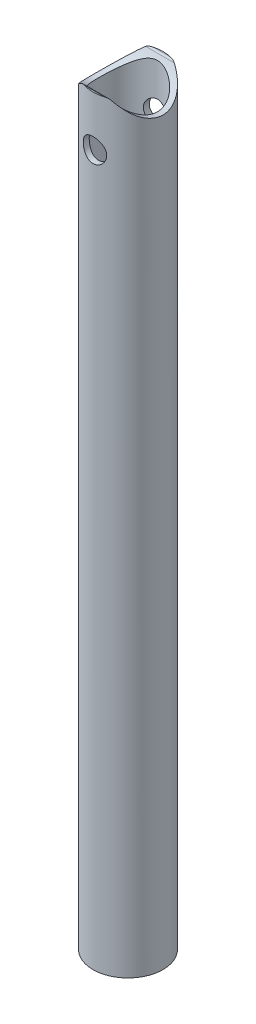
ISO-10303-21;
HEADER;
FILE_DESCRIPTION(('STEP AP214'),'2;1');
FILE_NAME('part.step','',(''),(''),'','','');
FILE_SCHEMA(('AUTOMOTIVE_DESIGN { 1 0 10303 214 1 1 1 1 }'));
ENDSEC;
DATA;
#1=APPLICATION_CONTEXT('core data for automotive mechanical design processes');
#2=APPLICATION_PROTOCOL_DEFINITION('international standard','automotive_design',2000,#1);
#3=PRODUCT_CONTEXT('',#1,'mechanical');
#4=PRODUCT('Part','Part','',(#3));
#5=PRODUCT_RELATED_PRODUCT_CATEGORY('part','',(#4));
#6=PRODUCT_DEFINITION_FORMATION('','',#4);
#7=PRODUCT_DEFINITION_CONTEXT('part definition',#1,'design');
#8=PRODUCT_DEFINITION('design','',#6,#7);
#9=PRODUCT_DEFINITION_SHAPE('','',#8);
#10=(LENGTH_UNIT() NAMED_UNIT(*) SI_UNIT(.MILLI.,.METRE.));
#11=(NAMED_UNIT(*) PLANE_ANGLE_UNIT() SI_UNIT($,.RADIAN.));
#12=(NAMED_UNIT(*) SI_UNIT($,.STERADIAN.) SOLID_ANGLE_UNIT());
#13=UNCERTAINTY_MEASURE_WITH_UNIT(LENGTH_MEASURE(1.E-05),#10,'distance_accuracy_value','');
#14=(GEOMETRIC_REPRESENTATION_CONTEXT(3) GLOBAL_UNCERTAINTY_ASSIGNED_CONTEXT((#13)) GLOBAL_UNIT_ASSIGNED_CONTEXT((#10,
#11,#12)) REPRESENTATION_CONTEXT('',''));
#15=CARTESIAN_POINT('',(0.,0.,0.));
#16=DIRECTION('',(0.,0.,1.));
#17=DIRECTION('',(1.,0.,0.));
#18=AXIS2_PLACEMENT_3D('',#15,#16,#17);
#19=CARTESIAN_POINT('',(0.,-175.5,0.));
#20=DIRECTION('',(0.,1.,0.));
#21=DIRECTION('',(0.,0.,1.));
#22=AXIS2_PLACEMENT_3D('',#19,#20,#21);
#23=CYLINDRICAL_SURFACE('',#22,15.8);
#24=CARTESIAN_POINT('',(0.,150.1,-15.8));
#25=CARTESIAN_POINT('',(0.289081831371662,150.100001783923,-15.800001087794));
#26=CARTESIAN_POINT('',(0.578152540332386,150.076271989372,-15.7919933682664));
#27=CARTESIAN_POINT('',(1.14777364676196,149.982273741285,-15.7608381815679));
#28=CARTESIAN_POINT('',(1.4283232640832,149.91200103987,-15.7376893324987));
#29=CARTESIAN_POINT('',(1.97260603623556,149.727604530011,-15.6787662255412));
#30=CARTESIAN_POINT('',(2.23636664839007,149.613554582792,-15.6430132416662));
#31=CARTESIAN_POINT('',(2.74102019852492,149.345164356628,-15.5625250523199));
#32=CARTESIAN_POINT('',(2.98190852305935,149.190815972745,-15.5177880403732));
#33=CARTESIAN_POINT('',(3.44238942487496,148.840582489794,-15.4222903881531));
#34=CARTESIAN_POINT('',(3.66106971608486,148.643540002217,-15.3713841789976));
#35=CARTESIAN_POINT('',(4.06305435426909,148.215792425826,-15.2700568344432));
#36=CARTESIAN_POINT('',(4.24635077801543,147.985079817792,-15.2196358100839));
#37=CARTESIAN_POINT('',(4.49340690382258,147.614654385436,-15.1478367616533));
#38=CARTESIAN_POINT('',(4.57203613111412,147.485052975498,-15.1242297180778));
#39=CARTESIAN_POINT('',(4.71804387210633,147.219299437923,-15.0793199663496));
#40=CARTESIAN_POINT('',(4.7854268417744,147.083149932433,-15.0580163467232));
#41=CARTESIAN_POINT('',(4.90839587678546,146.805183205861,-15.018383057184));
#42=CARTESIAN_POINT('',(4.9639798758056,146.663364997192,-15.0000539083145));
#43=CARTESIAN_POINT('',(5.062814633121,146.37515094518,-14.9669845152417));
#44=CARTESIAN_POINT('',(5.10607102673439,146.22875722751,-14.9522426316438));
#45=CARTESIAN_POINT('',(5.17860997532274,145.937438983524,-14.9272710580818));
#46=CARTESIAN_POINT('',(5.20831398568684,145.792630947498,-14.916906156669));
#47=CARTESIAN_POINT('',(5.25553220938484,145.500863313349,-14.9003358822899));
#48=CARTESIAN_POINT('',(5.27305151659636,145.353904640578,-14.8941287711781));
#49=CARTESIAN_POINT('',(5.29573758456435,145.058928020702,-14.8860776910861));
#50=CARTESIAN_POINT('',(5.30090524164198,144.910910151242,-14.8842334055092));
#51=CARTESIAN_POINT('',(5.29883564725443,144.614974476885,-14.8849703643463));
#52=CARTESIAN_POINT('',(5.29159875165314,144.46705666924,-14.8875514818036));
#53=CARTESIAN_POINT('',(5.26542351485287,144.179356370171,-14.896828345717));
#54=CARTESIAN_POINT('',(5.24704624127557,144.039516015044,-14.9033267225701));
#55=CARTESIAN_POINT('',(5.19925211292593,143.761914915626,-14.9200676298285));
#56=CARTESIAN_POINT('',(5.16983154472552,143.624154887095,-14.9303114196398));
#57=CARTESIAN_POINT('',(5.10022358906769,143.351732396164,-14.9542325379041));
#58=CARTESIAN_POINT('',(5.06003921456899,143.217069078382,-14.9679089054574));
#59=CARTESIAN_POINT('',(4.96922178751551,142.951615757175,-14.998304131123));
#60=CARTESIAN_POINT('',(4.91858475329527,142.820827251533,-15.015024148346));
#61=CARTESIAN_POINT('',(4.80637446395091,142.561925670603,-15.0513219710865));
#62=CARTESIAN_POINT('',(4.74464054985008,142.433887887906,-15.0709408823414));
#63=CARTESIAN_POINT('',(4.61125669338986,142.183423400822,-15.1122860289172));
#64=CARTESIAN_POINT('',(4.53960315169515,142.060998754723,-15.1340130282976));
#65=CARTESIAN_POINT('',(4.31048116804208,141.703256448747,-15.2014831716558));
#66=CARTESIAN_POINT('',(4.13877021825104,141.477284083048,-15.2495429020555));
#67=CARTESIAN_POINT('',(3.75179331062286,141.044634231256,-15.3494620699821));
#68=CARTESIAN_POINT('',(3.5347034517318,140.83961041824,-15.4013880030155));
#69=CARTESIAN_POINT('',(3.06856121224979,140.468411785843,-15.5009888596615));
#70=CARTESIAN_POINT('',(2.81950569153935,140.302240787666,-15.5486633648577));
#71=CARTESIAN_POINT('',(2.29299981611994,140.012163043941,-15.63502295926));
#72=CARTESIAN_POINT('',(2.01528672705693,139.88870276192,-15.6736118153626));
#73=CARTESIAN_POINT('',(1.44142703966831,139.690761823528,-15.7367547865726));
#74=CARTESIAN_POINT('',(1.14528696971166,139.616263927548,-15.7613138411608));
#75=CARTESIAN_POINT('',(0.556919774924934,139.521295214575,-15.792808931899));
#76=CARTESIAN_POINT('',(0.265090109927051,139.498599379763,-15.8004702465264));
#77=CARTESIAN_POINT('',(-0.318269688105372,139.501534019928,-15.7994850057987));
#78=CARTESIAN_POINT('',(-0.609799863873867,139.527156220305,-15.7908412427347));
#79=CARTESIAN_POINT('',(-1.1753436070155,139.624239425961,-15.7586964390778));
#80=CARTESIAN_POINT('',(-1.44962017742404,139.694330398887,-15.7356397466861));
#81=CARTESIAN_POINT('',(-1.98241319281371,139.876654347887,-15.677433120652));
#82=CARTESIAN_POINT('',(-2.24092761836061,139.98889271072,-15.6422816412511));
#83=CARTESIAN_POINT('',(-2.74246148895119,140.255579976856,-15.562299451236));
#84=CARTESIAN_POINT('',(-2.98488917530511,140.411068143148,-15.5172370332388));
#85=CARTESIAN_POINT('',(-3.44102215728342,140.758767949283,-15.4225054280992));
#86=CARTESIAN_POINT('',(-3.65471854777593,140.950990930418,-15.3728348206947));
#87=CARTESIAN_POINT('',(-3.95436169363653,141.267925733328,-15.2975276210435));
#88=CARTESIAN_POINT('',(-4.05266658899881,141.38117062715,-15.2717148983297));
#89=CARTESIAN_POINT('',(-4.23940598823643,141.615683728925,-15.2209322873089));
#90=CARTESIAN_POINT('',(-4.32784396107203,141.736949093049,-15.1959621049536));
#91=CARTESIAN_POINT('',(-4.49427573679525,141.98681026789,-15.1475743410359));
#92=CARTESIAN_POINT('',(-4.57226499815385,142.115409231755,-15.1241574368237));
#93=CARTESIAN_POINT('',(-4.71714810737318,142.379024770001,-15.0795973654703));
#94=CARTESIAN_POINT('',(-4.78404659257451,142.514038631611,-15.0584532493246));
#95=CARTESIAN_POINT('',(-4.90615479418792,142.789451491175,-15.0191130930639));
#96=CARTESIAN_POINT('',(-4.96137999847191,142.929843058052,-15.0009131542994));
#97=CARTESIAN_POINT('',(-5.05974035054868,143.215139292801,-14.9680232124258));
#98=CARTESIAN_POINT('',(-5.10288047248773,143.360042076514,-14.9533317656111));
#99=CARTESIAN_POINT('',(-5.17667523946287,143.65331253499,-14.9279455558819));
#100=CARTESIAN_POINT('',(-5.20733208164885,143.801679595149,-14.9172500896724));
#101=CARTESIAN_POINT('',(-5.25585146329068,144.100736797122,-14.9002244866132));
#102=CARTESIAN_POINT('',(-5.27371465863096,144.251426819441,-14.8938941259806));
#103=CARTESIAN_POINT('',(-5.29586136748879,144.545999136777,-14.8860330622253));
#104=CARTESIAN_POINT('',(-5.30080541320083,144.689825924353,-14.8842689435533));
#105=CARTESIAN_POINT('',(-5.29898111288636,144.977446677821,-14.8849185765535));
#106=CARTESIAN_POINT('',(-5.29220878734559,145.121240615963,-14.8873337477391));
#107=CARTESIAN_POINT('',(-5.26701636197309,145.407610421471,-14.8962651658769));
#108=CARTESIAN_POINT('',(-5.24860136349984,145.550186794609,-14.9027796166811));
#109=CARTESIAN_POINT('',(-5.20029977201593,145.833199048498,-14.9197029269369));
#110=CARTESIAN_POINT('',(-5.17040886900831,145.973634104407,-14.9301132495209));
#111=CARTESIAN_POINT('',(-5.10013570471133,146.24856393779,-14.9542625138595));
#112=CARTESIAN_POINT('',(-5.05997425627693,146.383121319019,-14.9679310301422));
#113=CARTESIAN_POINT('',(-4.96923612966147,146.648341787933,-14.9982989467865));
#114=CARTESIAN_POINT('',(-4.91865574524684,146.779003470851,-15.0149994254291));
#115=CARTESIAN_POINT('',(-4.75185944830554,147.163867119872,-15.0689600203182));
#116=CARTESIAN_POINT('',(-4.62053238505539,147.411165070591,-15.110099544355));
#117=CARTESIAN_POINT('',(-4.31473714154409,147.891564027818,-15.2003111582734));
#118=CARTESIAN_POINT('',(-4.13862212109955,148.123558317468,-15.2496530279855));
#119=CARTESIAN_POINT('',(-3.75097044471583,148.555589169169,-15.3496007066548));
#120=CARTESIAN_POINT('',(-3.53942371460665,148.755616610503,-15.4002068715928));
#121=CARTESIAN_POINT('',(-3.07685743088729,149.12598680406,-15.4993869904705));
#122=CARTESIAN_POINT('',(-2.82460516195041,149.294837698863,-15.547800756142));
#123=CARTESIAN_POINT('',(-2.29369641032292,149.587564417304,-15.6349346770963));
#124=CARTESIAN_POINT('',(-2.01504630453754,149.711451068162,-15.673657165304));
#125=CARTESIAN_POINT('',(-1.45083421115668,149.905925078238,-15.7357015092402));
#126=CARTESIAN_POINT('',(-1.16600900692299,149.978467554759,-15.7595834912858));
#127=CARTESIAN_POINT('',(-0.587450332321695,150.075497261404,-15.7917299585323));
#128=CARTESIAN_POINT('',(-0.29371942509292,150.099998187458,-15.7999988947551));
#129=CARTESIAN_POINT('',(0.,150.1,-15.8));
#130=B_SPLINE_CURVE_WITH_KNOTS('',3,(#24,#25,#26,#27,#28,#29,#30,#31,#32,#33,#34,#35,#36,#37,
#38,#39,#40,#41,#42,#43,#44,#45,#46,#47,#48,#49,#50,#51,#52,#53,#54,#55,#56,#57,#58,#59,#60,#61,
#62,#63,#64,#65,#66,#67,#68,#69,#70,#71,#72,#73,#74,#75,#76,#77,#78,#79,#80,#81,#82,#83,#84,#85,
#86,#87,#88,#89,#90,#91,#92,#93,#94,#95,#96,#97,#98,#99,#100,#101,#102,#103,#104,#105,#106,#107,
#108,#109,#110,#111,#112,#113,#114,#115,#116,#117,#118,#119,#120,#121,#122,#123,#124,#125,#126,
#127,#128,#129),.UNSPECIFIED.,.T.,.F.,(4,2,2,2,2,2,2,2,2,2,2,2,2,2,2,2,2,2,2,2,2,2,2,2,2,2,2,2,
2,2,2,2,2,2,2,2,2,2,2,2,2,2,2,2,2,2,2,2,2,2,2,2,4),(0.,0.866164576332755,1.73240821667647,
2.59719670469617,3.46215925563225,4.35442617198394,5.24689265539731,5.70666794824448,
6.16626063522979,6.62593374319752,7.08539638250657,7.52938913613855,7.97319616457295,
8.41697098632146,8.86073307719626,9.28381352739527,9.70703637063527,10.1301408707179,
10.5534068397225,10.9833834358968,11.4135164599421,12.2731743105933,13.1783202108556,
14.0835550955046,14.9979852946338,15.9120933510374,16.7861336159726,17.6600242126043,
18.5082182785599,19.356520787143,20.2272916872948,21.0983318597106,21.5543866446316,
22.0102805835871,22.4663720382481,22.9222723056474,23.3775638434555,23.8326677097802,
24.2876914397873,24.7426918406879,25.1739277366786,25.605310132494,26.0365036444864,
26.4678592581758,26.8906235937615,27.3135385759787,28.1587002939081,29.0411262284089,
29.9238034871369,30.8414864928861,31.758948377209,32.6392593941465,33.5193194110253),.UNSPECIFIED.);
#131=CARTESIAN_POINT('',(0.,150.1,-15.8));
#132=VERTEX_POINT('',#131);
#133=EDGE_CURVE('E164',#132,#132,#130,.T.);
#134=ORIENTED_EDGE('',*,*,#133,.F.);
#135=EDGE_LOOP('',(#134));
#136=FACE_BOUND('',#135,.T.);
#137=CARTESIAN_POINT('',(0.,139.5,15.8));
#138=CARTESIAN_POINT('',(0.289081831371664,139.499998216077,15.800001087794));
#139=CARTESIAN_POINT('',(0.57815254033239,139.523728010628,15.7919933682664));
#140=CARTESIAN_POINT('',(1.14777364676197,139.617726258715,15.7608381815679));
#141=CARTESIAN_POINT('',(1.4283232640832,139.68799896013,15.7376893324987));
#142=CARTESIAN_POINT('',(1.97260603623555,139.872395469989,15.6787662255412));
#143=CARTESIAN_POINT('',(2.23636664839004,139.986445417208,15.6430132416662));
#144=CARTESIAN_POINT('',(2.7410201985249,140.254835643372,15.5625250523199));
#145=CARTESIAN_POINT('',(2.98190852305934,140.409184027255,15.5177880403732));
#146=CARTESIAN_POINT('',(3.44238942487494,140.759417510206,15.4222903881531));
#147=CARTESIAN_POINT('',(3.66106971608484,140.956459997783,15.3713841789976));
#148=CARTESIAN_POINT('',(4.06305435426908,141.384207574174,15.2700568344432));
#149=CARTESIAN_POINT('',(4.24635077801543,141.614920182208,15.2196358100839));
#150=CARTESIAN_POINT('',(4.49340690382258,141.985345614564,15.1478367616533));
#151=CARTESIAN_POINT('',(4.57203613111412,142.114947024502,15.1242297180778));
#152=CARTESIAN_POINT('',(4.71804387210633,142.380700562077,15.0793199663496));
#153=CARTESIAN_POINT('',(4.7854268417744,142.516850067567,15.0580163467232));
#154=CARTESIAN_POINT('',(4.90839587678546,142.794816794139,15.018383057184));
#155=CARTESIAN_POINT('',(4.9639798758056,142.936635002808,15.0000539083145));
#156=CARTESIAN_POINT('',(5.062814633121,143.22484905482,14.9669845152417));
#157=CARTESIAN_POINT('',(5.10607102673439,143.37124277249,14.9522426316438));
#158=CARTESIAN_POINT('',(5.17860997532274,143.662561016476,14.9272710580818));
#159=CARTESIAN_POINT('',(5.20831398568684,143.807369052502,14.916906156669));
#160=CARTESIAN_POINT('',(5.25553220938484,144.099136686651,14.9003358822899));
#161=CARTESIAN_POINT('',(5.27305151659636,144.246095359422,14.8941287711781));
#162=CARTESIAN_POINT('',(5.29573758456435,144.541071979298,14.8860776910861));
#163=CARTESIAN_POINT('',(5.30090524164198,144.689089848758,14.8842334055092));
#164=CARTESIAN_POINT('',(5.29883564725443,144.985025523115,14.8849703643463));
#165=CARTESIAN_POINT('',(5.29159875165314,145.13294333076,14.8875514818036));
#166=CARTESIAN_POINT('',(5.26542351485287,145.420643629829,14.896828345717));
#167=CARTESIAN_POINT('',(5.24704624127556,145.560483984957,14.9033267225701));
#168=CARTESIAN_POINT('',(5.19925211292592,145.838085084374,14.9200676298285));
#169=CARTESIAN_POINT('',(5.16983154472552,145.975845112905,14.9303114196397));
#170=CARTESIAN_POINT('',(5.10022358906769,146.248267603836,14.9542325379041));
#171=CARTESIAN_POINT('',(5.06003921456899,146.382930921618,14.9679089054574));
#172=CARTESIAN_POINT('',(4.96922178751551,146.648384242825,14.998304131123));
#173=CARTESIAN_POINT('',(4.91858475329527,146.779172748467,15.015024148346));
#174=CARTESIAN_POINT('',(4.80637446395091,147.038074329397,15.0513219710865));
#175=CARTESIAN_POINT('',(4.74464054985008,147.166112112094,15.0709408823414));
#176=CARTESIAN_POINT('',(4.61125669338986,147.416576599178,15.1122860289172));
#177=CARTESIAN_POINT('',(4.53960315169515,147.539001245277,15.1340130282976));
#178=CARTESIAN_POINT('',(4.31048116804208,147.896743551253,15.2014831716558));
#179=CARTESIAN_POINT('',(4.13877021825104,148.122715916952,15.2495429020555));
#180=CARTESIAN_POINT('',(3.75179331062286,148.555365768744,15.3494620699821));
#181=CARTESIAN_POINT('',(3.5347034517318,148.76038958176,15.4013880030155));
#182=CARTESIAN_POINT('',(3.06856121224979,149.131588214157,15.5009888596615));
#183=CARTESIAN_POINT('',(2.81950569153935,149.297759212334,15.5486633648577));
#184=CARTESIAN_POINT('',(2.29299981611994,149.587836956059,15.63502295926));
#185=CARTESIAN_POINT('',(2.01528672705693,149.71129723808,15.6736118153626));
#186=CARTESIAN_POINT('',(1.44142703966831,149.909238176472,15.7367547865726));
#187=CARTESIAN_POINT('',(1.14528696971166,149.983736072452,15.7613138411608));
#188=CARTESIAN_POINT('',(0.556919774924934,150.078704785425,15.792808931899));
#189=CARTESIAN_POINT('',(0.265090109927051,150.101400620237,15.8004702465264));
#190=CARTESIAN_POINT('',(-0.318269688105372,150.098465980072,15.7994850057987));
#191=CARTESIAN_POINT('',(-0.609799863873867,150.072843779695,15.7908412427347));
#192=CARTESIAN_POINT('',(-1.1753436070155,149.975760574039,15.7586964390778));
#193=CARTESIAN_POINT('',(-1.44962017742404,149.905669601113,15.7356397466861));
#194=CARTESIAN_POINT('',(-1.9824131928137,149.723345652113,15.677433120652));
#195=CARTESIAN_POINT('',(-2.24092761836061,149.61110728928,15.6422816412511));
#196=CARTESIAN_POINT('',(-2.74246148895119,149.344420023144,15.562299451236));
#197=CARTESIAN_POINT('',(-2.98488917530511,149.188931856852,15.5172370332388));
#198=CARTESIAN_POINT('',(-3.44102215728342,148.841232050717,15.4225054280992));
#199=CARTESIAN_POINT('',(-3.65471854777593,148.649009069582,15.3728348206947));
#200=CARTESIAN_POINT('',(-3.95436169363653,148.332074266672,15.2975276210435));
#201=CARTESIAN_POINT('',(-4.05266658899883,148.21882937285,15.2717148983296));
#202=CARTESIAN_POINT('',(-4.23940598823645,147.984316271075,15.2209322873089));
#203=CARTESIAN_POINT('',(-4.32784396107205,147.863050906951,15.1959621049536));
#204=CARTESIAN_POINT('',(-4.49427573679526,147.61318973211,15.1475743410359));
#205=CARTESIAN_POINT('',(-4.57226499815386,147.484590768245,15.1241574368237));
#206=CARTESIAN_POINT('',(-4.71714810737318,147.220975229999,15.0795973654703));
#207=CARTESIAN_POINT('',(-4.78404659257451,147.085961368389,15.0584532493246));
#208=CARTESIAN_POINT('',(-4.90615479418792,146.810548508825,15.0191130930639));
#209=CARTESIAN_POINT('',(-4.96137999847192,146.670156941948,15.0009131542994));
#210=CARTESIAN_POINT('',(-5.05974035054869,146.384860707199,14.9680232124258));
#211=CARTESIAN_POINT('',(-5.10288047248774,146.239957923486,14.9533317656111));
#212=CARTESIAN_POINT('',(-5.17667523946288,145.94668746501,14.9279455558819));
#213=CARTESIAN_POINT('',(-5.20733208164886,145.798320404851,14.9172500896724));
#214=CARTESIAN_POINT('',(-5.25585146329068,145.499263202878,14.9002244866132));
#215=CARTESIAN_POINT('',(-5.27371465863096,145.348573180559,14.8938941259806));
#216=CARTESIAN_POINT('',(-5.29586136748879,145.054000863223,14.8860330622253));
#217=CARTESIAN_POINT('',(-5.30080541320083,144.910174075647,14.8842689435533));
#218=CARTESIAN_POINT('',(-5.29898111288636,144.622553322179,14.8849185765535));
#219=CARTESIAN_POINT('',(-5.29220878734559,144.478759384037,14.8873337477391));
#220=CARTESIAN_POINT('',(-5.26701636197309,144.192389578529,14.8962651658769));
#221=CARTESIAN_POINT('',(-5.24860136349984,144.049813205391,14.9027796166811));
#222=CARTESIAN_POINT('',(-5.20029977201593,143.766800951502,14.9197029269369));
#223=CARTESIAN_POINT('',(-5.17040886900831,143.626365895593,14.9301132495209));
#224=CARTESIAN_POINT('',(-5.10013570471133,143.35143606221,14.9542625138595));
#225=CARTESIAN_POINT('',(-5.05997425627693,143.216878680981,14.9679310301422));
#226=CARTESIAN_POINT('',(-4.96923612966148,142.951658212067,14.9982989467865));
#227=CARTESIAN_POINT('',(-4.91865574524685,142.820996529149,15.0149994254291));
#228=CARTESIAN_POINT('',(-4.75185944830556,142.436132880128,15.0689600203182));
#229=CARTESIAN_POINT('',(-4.6205323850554,142.188834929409,15.110099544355));
#230=CARTESIAN_POINT('',(-4.31473714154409,141.708435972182,15.2003111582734));
#231=CARTESIAN_POINT('',(-4.13862212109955,141.476441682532,15.2496530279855));
#232=CARTESIAN_POINT('',(-3.75097044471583,141.044410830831,15.3496007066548));
#233=CARTESIAN_POINT('',(-3.53942371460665,140.844383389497,15.4002068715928));
#234=CARTESIAN_POINT('',(-3.0768574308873,140.47401319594,15.4993869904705));
#235=CARTESIAN_POINT('',(-2.82460516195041,140.305162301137,15.547800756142));
#236=CARTESIAN_POINT('',(-2.29369641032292,140.012435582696,15.6349346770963));
#237=CARTESIAN_POINT('',(-2.01504630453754,139.888548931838,15.673657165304));
#238=CARTESIAN_POINT('',(-1.45083421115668,139.694074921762,15.7357015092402));
#239=CARTESIAN_POINT('',(-1.16600900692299,139.621532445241,15.7595834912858));
#240=CARTESIAN_POINT('',(-0.5874503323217,139.524502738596,15.7917299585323));
#241=CARTESIAN_POINT('',(-0.293719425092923,139.500001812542,15.7999988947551));
#242=CARTESIAN_POINT('',(0.,139.5,15.8));
#243=B_SPLINE_CURVE_WITH_KNOTS('',3,(#137,#138,#139,#140,#141,#142,#143,#144,#145,#146,#147,
#148,#149,#150,#151,#152,#153,#154,#155,#156,#157,#158,#159,#160,#161,#162,#163,#164,#165,#166,
#167,#168,#169,#170,#171,#172,#173,#174,#175,#176,#177,#178,#179,#180,#181,#182,#183,#184,#185,
#186,#187,#188,#189,#190,#191,#192,#193,#194,#195,#196,#197,#198,#199,#200,#201,#202,#203,#204,
#205,#206,#207,#208,#209,#210,#211,#212,#213,#214,#215,#216,#217,#218,#219,#220,#221,#222,#223,
#224,#225,#226,#227,#228,#229,#230,#231,#232,#233,#234,#235,#236,#237,#238,#239,#240,#241,#242),
.UNSPECIFIED.,.T.,.F.,(4,2,2,2,2,2,2,2,2,2,2,2,2,2,2,2,2,2,2,2,2,2,2,2,2,2,2,2,2,2,2,2,2,2,2,2,
2,2,2,2,2,2,2,2,2,2,2,2,2,2,2,2,4),(0.,0.866164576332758,1.73240821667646,2.59719670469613,
3.46215925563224,4.3544261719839,5.24689265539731,5.70666794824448,6.16626063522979,
6.62593374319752,7.08539638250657,7.52938913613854,7.97319616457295,8.41697098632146,
8.86073307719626,9.2838135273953,9.70703637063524,10.1301408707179,10.5534068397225,
10.9833834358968,11.4135164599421,12.2731743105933,13.1783202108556,14.0835550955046,
14.9979852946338,15.9120933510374,16.7861336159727,17.6600242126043,18.5082182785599,
19.356520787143,20.2272916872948,21.0983318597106,21.5543866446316,22.0102805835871,
22.4663720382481,22.9222723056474,23.3775638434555,23.8326677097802,24.2876914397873,
24.742691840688,25.1739277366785,25.605310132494,26.0365036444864,26.4678592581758,
26.8906235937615,27.3135385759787,28.1587002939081,29.0411262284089,29.9238034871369,
30.8414864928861,31.758948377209,32.6392593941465,33.5193194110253),.UNSPECIFIED.);
#244=CARTESIAN_POINT('',(0.,139.5,15.8));
#245=VERTEX_POINT('',#244);
#246=EDGE_CURVE('E168',#245,#245,#243,.T.);
#247=ORIENTED_EDGE('',*,*,#246,.F.);
#248=EDGE_LOOP('',(#247));
#249=FACE_BOUND('',#248,.T.);
#250=CARTESIAN_POINT('',(-6.43584792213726,166.985714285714,14.4298254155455));
#251=CARTESIAN_POINT('',(-6.40440774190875,167.010898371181,14.4438503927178));
#252=CARTESIAN_POINT('',(-6.3718275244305,167.034318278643,14.4582559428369));
#253=CARTESIAN_POINT('',(-6.30497436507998,167.078081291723,14.4875329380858));
#254=CARTESIAN_POINT('',(-6.27070567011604,167.098431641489,14.5024031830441));
#255=CARTESIAN_POINT('',(-6.16671555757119,167.155331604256,14.5470706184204));
#256=CARTESIAN_POINT('',(-6.09515345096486,167.188218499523,14.5772187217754));
#257=CARTESIAN_POINT('',(-5.96849073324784,167.238908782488,14.6294399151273));
#258=CARTESIAN_POINT('',(-5.91404164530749,167.258401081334,14.6515400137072));
#259=CARTESIAN_POINT('',(-5.80396866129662,167.294095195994,14.695491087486));
#260=CARTESIAN_POINT('',(-5.74834460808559,167.310296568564,14.7173420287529));
#261=CARTESIAN_POINT('',(-5.58002231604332,167.354818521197,14.7823479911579));
#262=CARTESIAN_POINT('',(-5.46600320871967,167.379008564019,14.8249027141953));
#263=CARTESIAN_POINT('',(-5.23432446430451,167.419579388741,14.908294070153));
#264=CARTESIAN_POINT('',(-5.11663673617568,167.435854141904,14.9491010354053));
#265=CARTESIAN_POINT('',(-4.87967597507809,167.462108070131,15.0281191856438));
#266=CARTESIAN_POINT('',(-4.76040244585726,167.472085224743,15.0663295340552));
#267=CARTESIAN_POINT('',(-4.52182407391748,167.487113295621,15.1396346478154));
#268=CARTESIAN_POINT('',(-4.40252965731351,167.492208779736,15.1747548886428));
#269=CARTESIAN_POINT('',(-4.16492945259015,167.498605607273,15.2416658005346));
#270=CARTESIAN_POINT('',(-4.0466376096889,167.499965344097,15.2735001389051));
#271=CARTESIAN_POINT('',(-3.92801823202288,167.5,15.3039430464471));
#272=B_SPLINE_CURVE_WITH_KNOTS('',3,(#250,#251,#252,#253,#254,#255,#256,#257,#258,#259,#260,
#261,#262,#263,#264,#265,#266,#267,#268,#269,#270,#271),.UNSPECIFIED.,.F.,.F.,(4,2,2,2,2,2,2,2,
2,2,4),(0.,0.127797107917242,0.255287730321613,0.507684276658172,0.693332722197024,
0.879006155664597,1.25079497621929,1.62743556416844,2.00419692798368,2.37748486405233,
2.74490382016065),.UNSPECIFIED.);
#273=CARTESIAN_POINT('',(-6.43584792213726,166.985714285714,14.4298254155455));
#274=VERTEX_POINT('',#273);
#275=CARTESIAN_POINT('',(-3.92801823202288,167.5,15.3039430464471));
#276=VERTEX_POINT('',#275);
#277=EDGE_CURVE('E44',#274,#276,#272,.T.);
#278=ORIENTED_EDGE('',*,*,#277,.F.);
#279=CARTESIAN_POINT('',(-6.46663109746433,166.985714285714,-14.416056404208));
#280=CARTESIAN_POINT('',(-6.71138033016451,166.788033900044,-14.3062348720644));
#281=CARTESIAN_POINT('',(-6.95271140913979,166.58940622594,-14.1905254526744));
#282=CARTESIAN_POINT('',(-7.4288463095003,166.191588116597,-13.9471858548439));
#283=CARTESIAN_POINT('',(-7.66364964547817,165.992397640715,-13.8195547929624));
#284=CARTESIAN_POINT('',(-8.12750599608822,165.594382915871,-13.5519523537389));
#285=CARTESIAN_POINT('',(-8.35654538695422,165.39556040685,-13.4119547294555));
#286=CARTESIAN_POINT('',(-8.80830601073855,164.999815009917,-13.119684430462));
#287=CARTESIAN_POINT('',(-9.0310273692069,164.802892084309,-12.9674119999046));
#288=CARTESIAN_POINT('',(-9.69462638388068,164.211916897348,-12.488172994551));
#289=CARTESIAN_POINT('',(-10.1256473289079,163.822240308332,-12.1418208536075));
#290=CARTESIAN_POINT('',(-10.95781198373,163.062745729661,-11.3963979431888));
#291=CARTESIAN_POINT('',(-11.3589856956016,162.692907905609,-10.9973812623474));
#292=CARTESIAN_POINT('',(-11.9912841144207,162.106180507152,-10.2950050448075));
#293=CARTESIAN_POINT('',(-12.2325609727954,161.881275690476,-10.0074107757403));
#294=CARTESIAN_POINT('',(-12.6985591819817,161.445406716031,-9.40905769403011));
#295=CARTESIAN_POINT('',(-12.9232808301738,161.234442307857,-9.09829929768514));
#296=CARTESIAN_POINT('',(-13.3530249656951,160.829905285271,-8.45492707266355));
#297=CARTESIAN_POINT('',(-13.5581205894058,160.636268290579,-8.1224028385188));
#298=CARTESIAN_POINT('',(-13.9469759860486,160.2683415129,-7.43489970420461));
#299=CARTESIAN_POINT('',(-14.1307396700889,160.094048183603,-7.07992493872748));
#300=CARTESIAN_POINT('',(-14.4437209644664,159.796685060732,-6.41323201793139));
#301=CARTESIAN_POINT('',(-14.5768395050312,159.670005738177,-6.10495160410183));
#302=CARTESIAN_POINT('',(-14.8249716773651,159.433596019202,-5.47492314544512));
#303=CARTESIAN_POINT('',(-14.9399890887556,159.323862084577,-5.15317792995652));
#304=CARTESIAN_POINT('',(-15.1502739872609,159.123040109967,-4.49752505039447));
#305=CARTESIAN_POINT('',(-15.2455376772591,159.031955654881,-4.1636150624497));
#306=CARTESIAN_POINT('',(-15.4146956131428,158.870083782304,-3.48557408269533));
#307=CARTESIAN_POINT('',(-15.4885896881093,158.799296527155,-3.1414430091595));
#308=CARTESIAN_POINT('',(-15.6140092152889,158.679054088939,-2.44320969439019));
#309=CARTESIAN_POINT('',(-15.6653961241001,158.629731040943,-2.08905959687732));
#310=CARTESIAN_POINT('',(-15.744090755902,158.554110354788,-1.37563864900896));
#311=CARTESIAN_POINT('',(-15.7713984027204,158.527812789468,-1.01636778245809));
#312=CARTESIAN_POINT('',(-15.8013394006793,158.498842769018,-0.295968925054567));
#313=CARTESIAN_POINT('',(-15.8039812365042,158.496162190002,0.0651583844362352));
#314=CARTESIAN_POINT('',(-15.7845501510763,158.514467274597,0.78612580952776));
#315=CARTESIAN_POINT('',(-15.7624790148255,158.535451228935,1.14596601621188));
#316=CARTESIAN_POINT('',(-15.6975899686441,158.59727693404,1.82478844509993));
#317=CARTESIAN_POINT('',(-15.657110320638,158.635882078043,2.14420409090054));
#318=CARTESIAN_POINT('',(-15.5572876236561,158.731098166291,2.77731609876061));
#319=CARTESIAN_POINT('',(-15.4979461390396,158.787707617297,3.09101293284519));
#320=CARTESIAN_POINT('',(-15.3613235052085,158.917994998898,3.71086012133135));
#321=CARTESIAN_POINT('',(-15.2840411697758,158.991674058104,4.01700997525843));
#322=CARTESIAN_POINT('',(-15.1126456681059,159.154970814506,4.62020191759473));
#323=CARTESIAN_POINT('',(-15.018531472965,159.244589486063,4.91724344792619));
#324=CARTESIAN_POINT('',(-14.8091133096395,159.443822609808,5.51692602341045));
#325=CARTESIAN_POINT('',(-14.6929322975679,159.554262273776,5.81898566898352));
#326=CARTESIAN_POINT('',(-14.44462597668,159.79000594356,6.41059722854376));
#327=CARTESIAN_POINT('',(-14.3124945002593,159.915315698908,6.70014424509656));
#328=CARTESIAN_POINT('',(-14.0337563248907,160.179260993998,7.26588826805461));
#329=CARTESIAN_POINT('',(-13.8871486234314,160.317897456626,7.54208434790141));
#330=CARTESIAN_POINT('',(-13.5808207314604,160.607038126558,8.08067659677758));
#331=CARTESIAN_POINT('',(-13.4210977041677,160.757544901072,8.34306976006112));
#332=CARTESIAN_POINT('',(-12.9984135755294,161.154969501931,8.99468079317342));
#333=CARTESIAN_POINT('',(-12.7271001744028,161.409277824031,9.37402748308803));
#334=CARTESIAN_POINT('',(-12.1600638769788,161.938386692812,10.0987500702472));
#335=CARTESIAN_POINT('',(-11.8643292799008,162.213197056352,10.4441095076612));
#336=CARTESIAN_POINT('',(-11.2510142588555,162.779758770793,11.1021406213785));
#337=CARTESIAN_POINT('',(-10.9333752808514,163.07155517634,11.4147185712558));
#338=CARTESIAN_POINT('',(-10.2796218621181,163.667403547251,12.0068260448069));
#339=CARTESIAN_POINT('',(-9.94351170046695,163.971452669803,12.2863631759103));
#340=CARTESIAN_POINT('',(-9.35129141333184,164.50143657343,12.7393323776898));
#341=CARTESIAN_POINT('',(-9.09922530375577,164.725326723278,12.9205147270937));
#342=CARTESIAN_POINT('',(-8.58675834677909,165.176042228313,13.2666191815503));
#343=CARTESIAN_POINT('',(-8.32635851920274,165.402867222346,13.4315432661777));
#344=CARTESIAN_POINT('',(-7.79921179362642,165.856209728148,13.7442913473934));
#345=CARTESIAN_POINT('',(-7.53252566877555,166.082717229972,13.8922321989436));
#346=CARTESIAN_POINT('',(-7.12617064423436,166.422068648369,14.1025155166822));
#347=CARTESIAN_POINT('',(-6.98965877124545,166.535122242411,14.1706745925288));
#348=CARTESIAN_POINT('',(-6.71443079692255,166.760806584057,14.3031366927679));
#349=CARTESIAN_POINT('',(-6.57571467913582,166.873437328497,14.3674396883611));
#350=CARTESIAN_POINT('',(-6.43584792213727,166.985714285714,14.4298254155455));
#351=B_SPLINE_CURVE_WITH_KNOTS('',3,(#279,#280,#281,#282,#283,#284,#285,#286,#287,#288,#289,
#290,#291,#292,#293,#294,#295,#296,#297,#298,#299,#300,#301,#302,#303,#304,#305,#306,#307,#308,
#309,#310,#311,#312,#313,#314,#315,#316,#317,#318,#319,#320,#321,#322,#323,#324,#325,#326,#327,
#328,#329,#330,#331,#332,#333,#334,#335,#336,#337,#338,#339,#340,#341,#342,#343,#344,#345,#346,
#347,#348,#349,#350),.UNSPECIFIED.,.F.,.F.,(4,2,2,2,2,2,2,2,2,2,2,2,2,2,2,2,2,2,2,2,2,2,2,2,2,2,
2,2,2,2,2,2,2,2,2,4),(0.,0.999598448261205,1.99927102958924,3.00111879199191,4.0029466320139,
6.02941757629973,8.05382321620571,9.36567282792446,10.6774988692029,11.9842286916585,
13.2907185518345,14.3663858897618,15.4418283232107,16.5174772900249,17.5931348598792,
18.6753236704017,19.7575159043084,20.839335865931,21.9210776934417,22.8928048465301,
23.8644514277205,24.8361622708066,25.8079325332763,26.8328195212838,27.8581040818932,
28.8834596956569,29.909037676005,31.500269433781,33.0922680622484,34.6887009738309,
36.2847655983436,37.4325643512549,38.5802231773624,39.7194405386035,40.2890972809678,
40.8587582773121),.UNSPECIFIED.);
#352=CARTESIAN_POINT('',(-6.46663109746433,166.985714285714,-14.416056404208));
#353=VERTEX_POINT('',#352);
#354=EDGE_CURVE('E92',#353,#274,#351,.T.);
#355=ORIENTED_EDGE('',*,*,#354,.F.);
#356=CARTESIAN_POINT('',(-3.98127843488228,167.5,-15.2901740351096));
#357=CARTESIAN_POINT('',(-4.06425518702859,167.499992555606,-15.2685690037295));
#358=CARTESIAN_POINT('',(-4.14706195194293,167.499299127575,-15.2462858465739));
#359=CARTESIAN_POINT('',(-4.31230069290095,167.496227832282,-15.2003754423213));
#360=CARTESIAN_POINT('',(-4.39473252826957,167.493849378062,-15.1767477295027));
#361=CARTESIAN_POINT('',(-4.55975027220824,167.487069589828,-15.1279918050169));
#362=CARTESIAN_POINT('',(-4.64233263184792,167.482653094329,-15.1028535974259));
#363=CARTESIAN_POINT('',(-4.80691757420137,167.471404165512,-15.0512783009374));
#364=CARTESIAN_POINT('',(-4.88892023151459,167.464572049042,-15.0248413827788));
#365=CARTESIAN_POINT('',(-5.048720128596,167.448379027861,-14.9718804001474));
#366=CARTESIAN_POINT('',(-5.12654681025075,167.439139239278,-14.9454087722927));
#367=CARTESIAN_POINT('',(-5.28138500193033,167.417509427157,-14.8913966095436));
#368=CARTESIAN_POINT('',(-5.35839661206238,167.405119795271,-14.8638562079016));
#369=CARTESIAN_POINT('',(-5.51118571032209,167.376573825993,-14.8078842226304));
#370=CARTESIAN_POINT('',(-5.58696571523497,167.360426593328,-14.7794549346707));
#371=CARTESIAN_POINT('',(-5.73707785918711,167.323506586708,-14.7218338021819));
#372=CARTESIAN_POINT('',(-5.81141074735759,167.302736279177,-14.6926423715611));
#373=CARTESIAN_POINT('',(-5.93620999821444,167.262426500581,-14.6425575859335));
#374=CARTESIAN_POINT('',(-5.98719570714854,167.24436026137,-14.6217800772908));
#375=CARTESIAN_POINT('',(-6.08775106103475,167.204812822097,-14.5802003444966));
#376=CARTESIAN_POINT('',(-6.13732228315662,167.183335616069,-14.5593981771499));
#377=CARTESIAN_POINT('',(-6.23528499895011,167.135864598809,-14.5177163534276));
#378=CARTESIAN_POINT('',(-6.28364933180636,167.109810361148,-14.4968398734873));
#379=CARTESIAN_POINT('',(-6.35408728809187,167.066667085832,-14.4660373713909));
#380=CARTESIAN_POINT('',(-6.37726127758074,167.051573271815,-14.4558345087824));
#381=CARTESIAN_POINT('',(-6.42269164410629,167.019843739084,-14.4357075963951));
#382=CARTESIAN_POINT('',(-6.44494705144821,167.003206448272,-14.4257838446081));
#383=CARTESIAN_POINT('',(-6.46663109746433,166.985714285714,-14.416056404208));
#384=B_SPLINE_CURVE_WITH_KNOTS('',3,(#356,#357,#358,#359,#360,#361,#362,#363,#364,#365,#366,
#367,#368,#369,#370,#371,#372,#373,#374,#375,#376,#377,#378,#379,#380,#381,#382,#383),
.UNSPECIFIED.,.F.,.F.,(4,2,2,2,2,2,2,2,2,2,2,2,2,4),(0.,0.25723403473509,0.514557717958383,
0.773827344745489,1.03306297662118,1.28117263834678,1.52925146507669,1.77673533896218,
2.02408749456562,2.19782785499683,2.37136625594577,2.54739652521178,2.63578094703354,
2.72425640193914),.UNSPECIFIED.);
#385=CARTESIAN_POINT('',(-3.98127843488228,167.5,-15.2901740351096));
#386=VERTEX_POINT('',#385);
#387=EDGE_CURVE('E77',#386,#353,#384,.T.);
#388=ORIENTED_EDGE('',*,*,#387,.F.);
#389=CARTESIAN_POINT('',(0.,167.5,0.));
#390=DIRECTION('',(0.,-1.,0.));
#391=DIRECTION('',(0.,0.,-1.));
#392=AXIS2_PLACEMENT_3D('',#389,#390,#391);
#393=CIRCLE('',#392,15.8);
#394=CARTESIAN_POINT('',(3.98127843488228,167.5,-15.2901740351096));
#395=VERTEX_POINT('',#394);
#396=EDGE_CURVE('E86',#395,#386,#393,.F.);
#397=ORIENTED_EDGE('',*,*,#396,.F.);
#398=CARTESIAN_POINT('',(6.46663109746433,166.985714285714,-14.416056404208));
#399=CARTESIAN_POINT('',(6.43526739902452,167.010981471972,-14.4301276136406));
#400=CARTESIAN_POINT('',(6.40275636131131,167.034479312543,-14.4445858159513));
#401=CARTESIAN_POINT('',(6.33603040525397,167.078387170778,-14.4739776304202));
#402=CARTESIAN_POINT('',(6.30181979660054,167.098804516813,-14.4889100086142));
#403=CARTESIAN_POINT('',(6.19799382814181,167.155886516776,-14.533771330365));
#404=CARTESIAN_POINT('',(6.12652545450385,167.188873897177,-14.5640613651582));
#405=CARTESIAN_POINT('',(6.00041699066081,167.239543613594,-14.6163722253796));
#406=CARTESIAN_POINT('',(5.94644430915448,167.25895341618,-14.6384172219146));
#407=CARTESIAN_POINT('',(5.83733184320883,167.294510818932,-14.6822686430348));
#408=CARTESIAN_POINT('',(5.78219191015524,167.310658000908,-14.7040750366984));
#409=CARTESIAN_POINT('',(5.6153310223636,167.355046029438,-14.768963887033));
#410=CARTESIAN_POINT('',(5.5022957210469,167.379185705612,-14.811463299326));
#411=CARTESIAN_POINT('',(5.2726090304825,167.419690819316,-14.8947890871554));
#412=CARTESIAN_POINT('',(5.1559297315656,167.435951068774,-14.9355865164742));
#413=CARTESIAN_POINT('',(4.92099047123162,167.46218976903,-15.0146335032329));
#414=CARTESIAN_POINT('',(4.802730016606,167.472166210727,-15.0528822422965));
#415=CARTESIAN_POINT('',(4.5668252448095,167.487147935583,-15.1261077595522));
#416=CARTESIAN_POINT('',(4.44919748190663,167.492224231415,-15.1611244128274));
#417=CARTESIAN_POINT('',(4.21490474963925,167.498604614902,-15.2279087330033));
#418=CARTESIAN_POINT('',(4.098253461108,167.499966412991,-15.2597186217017));
#419=CARTESIAN_POINT('',(3.98127843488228,167.5,-15.2901740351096));
#420=B_SPLINE_CURVE_WITH_KNOTS('',3,(#398,#399,#400,#401,#402,#403,#404,#405,#406,#407,#408,
#409,#410,#411,#412,#413,#414,#415,#416,#417,#418,#419),.UNSPECIFIED.,.F.,.F.,(4,2,2,2,2,2,2,2,
2,2,4),(0.,0.127819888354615,0.255330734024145,0.507752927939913,0.692009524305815,
0.876289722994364,1.24528401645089,1.61907714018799,1.99298971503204,2.36139838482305,
2.72404975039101),.UNSPECIFIED.);
#421=CARTESIAN_POINT('',(6.46663109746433,166.985714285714,-14.416056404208));
#422=VERTEX_POINT('',#421);
#423=EDGE_CURVE('E59',#422,#395,#420,.T.);
#424=ORIENTED_EDGE('',*,*,#423,.F.);
#425=CARTESIAN_POINT('',(6.43584792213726,166.985714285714,14.4298254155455));
#426=CARTESIAN_POINT('',(6.681256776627,166.788630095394,14.3203359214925));
#427=CARTESIAN_POINT('',(6.92320608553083,166.59052933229,14.2049506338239));
#428=CARTESIAN_POINT('',(7.40051074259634,166.193654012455,13.962249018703));
#429=CARTESIAN_POINT('',(7.63586563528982,165.994879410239,13.8349318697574));
#430=CARTESIAN_POINT('',(8.10077310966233,165.597615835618,13.5679548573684));
#431=CARTESIAN_POINT('',(8.33031209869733,165.399128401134,13.4282689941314));
#432=CARTESIAN_POINT('',(8.78303676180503,165.003982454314,13.1366193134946));
#433=CARTESIAN_POINT('',(9.00622255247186,164.807323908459,12.9846557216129));
#434=CARTESIAN_POINT('',(9.67117928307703,164.217068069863,12.5063560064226));
#435=CARTESIAN_POINT('',(10.1030560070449,163.827756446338,12.1606346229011));
#436=CARTESIAN_POINT('',(10.9369002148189,163.068805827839,11.4164780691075));
#437=CARTESIAN_POINT('',(11.338897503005,162.699147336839,11.018096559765));
#438=CARTESIAN_POINT('',(11.9728866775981,162.112285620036,10.3164142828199));
#439=CARTESIAN_POINT('',(12.2150074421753,161.88712868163,10.0288483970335));
#440=CARTESIAN_POINT('',(12.682665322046,161.450729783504,9.43049102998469));
#441=CARTESIAN_POINT('',(12.9082027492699,161.239487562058,9.11969998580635));
#442=CARTESIAN_POINT('',(13.3395488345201,160.834380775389,8.47619553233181));
#443=CARTESIAN_POINT('',(13.5454306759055,160.640451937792,8.14357190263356));
#444=CARTESIAN_POINT('',(13.935828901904,160.271938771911,7.45579898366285));
#445=CARTESIAN_POINT('',(14.1203492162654,160.097350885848,7.1006538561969));
#446=CARTESIAN_POINT('',(14.4345666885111,159.799565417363,6.43381742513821));
#447=CARTESIAN_POINT('',(14.5681833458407,159.672744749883,6.12558737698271));
#448=CARTESIAN_POINT('',(14.8173127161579,159.4360394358,5.49562689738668));
#449=CARTESIAN_POINT('',(14.9328292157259,159.326151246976,5.17389930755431));
#450=CARTESIAN_POINT('',(15.1441110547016,159.125012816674,4.51824513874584));
#451=CARTESIAN_POINT('',(15.2398726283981,159.033766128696,4.18431624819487));
#452=CARTESIAN_POINT('',(15.4100214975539,158.871567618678,3.50619674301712));
#453=CARTESIAN_POINT('',(15.4844086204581,158.800615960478,3.16200604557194));
#454=CARTESIAN_POINT('',(15.6108089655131,158.68004694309,2.46360038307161));
#455=CARTESIAN_POINT('',(15.6626829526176,158.630562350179,2.10933708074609));
#456=CARTESIAN_POINT('',(15.742334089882,158.554632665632,1.39564573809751));
#457=CARTESIAN_POINT('',(15.770111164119,158.528187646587,1.03621768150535));
#458=CARTESIAN_POINT('',(15.8009666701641,158.498944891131,0.315464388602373));
#459=CARTESIAN_POINT('',(15.8040536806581,158.496138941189,-0.0458601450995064));
#460=CARTESIAN_POINT('',(15.7854831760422,158.514222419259,-0.767258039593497));
#461=CARTESIAN_POINT('',(15.763827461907,158.535110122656,-1.12733148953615));
#462=CARTESIAN_POINT('',(15.699707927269,158.596773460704,-1.80648429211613));
#463=CARTESIAN_POINT('',(15.6595941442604,158.635301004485,-2.12599587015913));
#464=CARTESIAN_POINT('',(15.560490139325,158.730377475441,-2.75932267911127));
#465=CARTESIAN_POINT('',(15.5015014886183,158.786924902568,-3.07313838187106));
#466=CARTESIAN_POINT('',(15.3655698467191,158.917106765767,-3.69324227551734));
#467=CARTESIAN_POINT('',(15.2886256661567,158.990742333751,-3.99952996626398));
#468=CARTESIAN_POINT('',(15.1178911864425,159.153972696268,-4.60301226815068));
#469=CARTESIAN_POINT('',(15.02409985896,159.24356846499,-4.90020632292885));
#470=CARTESIAN_POINT('',(14.8153834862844,159.442725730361,-5.50005877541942));
#471=CARTESIAN_POINT('',(14.6995892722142,159.553105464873,-5.80214212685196));
#472=CARTESIAN_POINT('',(14.4520567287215,159.78874028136,-6.39382177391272));
#473=CARTESIAN_POINT('',(14.3203122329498,159.914001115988,-6.6834131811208));
#474=CARTESIAN_POINT('',(14.0423486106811,160.17786182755,-7.24926315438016));
#475=CARTESIAN_POINT('',(13.8961285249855,160.316462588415,-7.52552083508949));
#476=CARTESIAN_POINT('',(13.5905770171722,160.605547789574,-8.06425204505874));
#477=CARTESIAN_POINT('',(13.4312427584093,160.756034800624,-8.32672257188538));
#478=CARTESIAN_POINT('',(13.0096197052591,161.153370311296,-8.9784470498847));
#479=CARTESIAN_POINT('',(12.7389878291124,161.407615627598,-9.35784813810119));
#480=CARTESIAN_POINT('',(12.1733411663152,161.936642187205,-10.0827244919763));
#481=CARTESIAN_POINT('',(11.8783146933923,162.211433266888,-10.4281833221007));
#482=CARTESIAN_POINT('',(11.2664527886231,162.77801693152,-11.0864568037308));
#483=CARTESIAN_POINT('',(10.9495587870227,163.069854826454,-11.3991776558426));
#484=CARTESIAN_POINT('',(10.2973474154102,163.665865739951,-11.9916106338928));
#485=CARTESIAN_POINT('',(9.96203432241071,163.970035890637,-12.271330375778));
#486=CARTESIAN_POINT('',(9.3714571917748,164.500135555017,-12.7244892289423));
#487=CARTESIAN_POINT('',(9.12022624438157,164.72399015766,-12.9056826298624));
#488=CARTESIAN_POINT('',(8.60949411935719,165.174704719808,-13.2518596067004));
#489=CARTESIAN_POINT('',(8.34999394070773,165.401564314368,-13.4168451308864));
#490=CARTESIAN_POINT('',(7.82472464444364,165.855069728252,-13.7297657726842));
#491=CARTESIAN_POINT('',(7.55901581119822,166.081704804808,-13.8778175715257));
#492=CARTESIAN_POINT('',(7.15420504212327,166.421349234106,-14.088309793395));
#493=CARTESIAN_POINT('',(7.01822139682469,166.53451712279,-14.1565454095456));
#494=CARTESIAN_POINT('',(6.74408007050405,166.760471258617,-14.2891758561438));
#495=CARTESIAN_POINT('',(6.60592237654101,166.873257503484,-14.353570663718));
#496=CARTESIAN_POINT('',(6.46663109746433,166.985714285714,-14.416056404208));
#497=B_SPLINE_CURVE_WITH_KNOTS('',3,(#425,#426,#427,#428,#429,#430,#431,#432,#433,#434,#435,
#436,#437,#438,#439,#440,#441,#442,#443,#444,#445,#446,#447,#448,#449,#450,#451,#452,#453,#454,
#455,#456,#457,#458,#459,#460,#461,#462,#463,#464,#465,#466,#467,#468,#469,#470,#471,#472,#473,
#474,#475,#476,#477,#478,#479,#480,#481,#482,#483,#484,#485,#486,#487,#488,#489,#490,#491,#492,
#493,#494,#495,#496),.UNSPECIFIED.,.F.,.F.,(4,2,2,2,2,2,2,2,2,2,2,2,2,2,2,2,2,2,2,2,2,2,2,2,2,2,
2,2,2,2,2,2,2,2,2,4),(0.,0.999664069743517,1.99939701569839,3.0012837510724,4.00315208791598,
6.02966408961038,8.05412675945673,9.3677045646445,10.6812576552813,11.9897118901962,
13.2979250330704,14.3741677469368,15.450185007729,16.5264071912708,17.6026380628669,
18.6854333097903,19.7682319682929,20.8506543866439,21.932998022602,22.9048437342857,
23.8766085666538,24.8484377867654,25.8203263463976,26.8448245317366,27.8697200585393,
28.8946835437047,29.9198693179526,31.5100852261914,33.1010673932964,34.69648992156,
36.2915435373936,37.4376491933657,38.5836169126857,39.7211403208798,40.2899467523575,
40.8587565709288),.UNSPECIFIED.);
#498=CARTESIAN_POINT('',(6.43584792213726,166.985714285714,14.4298254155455));
#499=VERTEX_POINT('',#498);
#500=EDGE_CURVE('E95',#499,#422,#497,.T.);
#501=ORIENTED_EDGE('',*,*,#500,.F.);
#502=CARTESIAN_POINT('',(3.92801823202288,167.5,15.3039430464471));
#503=CARTESIAN_POINT('',(4.01101352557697,167.499992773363,15.28264144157));
#504=CARTESIAN_POINT('',(4.09384118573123,167.499318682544,15.2606621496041));
#505=CARTESIAN_POINT('',(4.25912703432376,167.496329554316,15.2153599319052));
#506=CARTESIAN_POINT('',(4.34158509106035,167.494013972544,15.1920365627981));
#507=CARTESIAN_POINT('',(4.50662387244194,167.487410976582,15.1439024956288));
#508=CARTESIAN_POINT('',(4.58920134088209,167.483109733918,15.11908244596));
#509=CARTESIAN_POINT('',(4.75378974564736,167.472150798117,15.0681419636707));
#510=CARTESIAN_POINT('',(4.83580075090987,167.46549339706,15.0420216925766));
#511=CARTESIAN_POINT('',(4.9957234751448,167.449702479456,14.9896473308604));
#512=CARTESIAN_POINT('',(5.07366317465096,167.44068418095,14.9634445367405));
#513=CARTESIAN_POINT('',(5.22874901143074,167.41956767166,14.9099600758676));
#514=CARTESIAN_POINT('',(5.3058952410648,167.407469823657,14.8826785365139));
#515=CARTESIAN_POINT('',(5.45900053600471,167.379591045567,14.8272022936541));
#516=CARTESIAN_POINT('',(5.534961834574,167.363818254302,14.7990097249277));
#517=CARTESIAN_POINT('',(5.68548613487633,167.327756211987,14.7418356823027));
#518=CARTESIAN_POINT('',(5.76004981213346,167.30746920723,14.7128546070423));
#519=CARTESIAN_POINT('',(5.88690248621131,167.267608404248,14.662457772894));
#520=CARTESIAN_POINT('',(5.93965958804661,167.249383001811,14.641161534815));
#521=CARTESIAN_POINT('',(6.04371867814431,167.209383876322,14.5985143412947));
#522=CARTESIAN_POINT('',(6.09502237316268,167.187614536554,14.5771634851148));
#523=CARTESIAN_POINT('',(6.19642222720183,167.13936632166,14.5343529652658));
#524=CARTESIAN_POINT('',(6.24649019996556,167.112823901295,14.5128961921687));
#525=CARTESIAN_POINT('',(6.319400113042,167.068738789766,14.4812254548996));
#526=CARTESIAN_POINT('',(6.3433877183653,167.053293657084,14.4707320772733));
#527=CARTESIAN_POINT('',(6.39040110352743,167.020773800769,14.4500324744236));
#528=CARTESIAN_POINT('',(6.41342580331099,167.003697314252,14.4398265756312));
#529=CARTESIAN_POINT('',(6.43584792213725,166.985714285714,14.4298254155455));
#530=B_SPLINE_CURVE_WITH_KNOTS('',3,(#502,#503,#504,#505,#506,#507,#508,#509,#510,#511,#512,
#513,#514,#515,#516,#517,#518,#519,#520,#521,#522,#523,#524,#525,#526,#527,#528,#529),
.UNSPECIFIED.,.F.,.F.,(4,2,2,2,2,2,2,2,2,2,2,2,2,4),(0.,0.257059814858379,0.514204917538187,
0.773168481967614,1.03209995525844,1.28020089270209,1.52827261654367,1.77580007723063,
2.02320464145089,2.20232889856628,2.38123326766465,2.56272446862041,2.65386639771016,
2.74510795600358),.UNSPECIFIED.);
#531=CARTESIAN_POINT('',(3.92801823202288,167.5,15.3039430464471));
#532=VERTEX_POINT('',#531);
#533=EDGE_CURVE('E11',#532,#499,#530,.T.);
#534=ORIENTED_EDGE('',*,*,#533,.F.);
#535=CARTESIAN_POINT('',(0.,167.5,0.));
#536=DIRECTION('',(0.,-1.,0.));
#537=DIRECTION('',(0.,0.,-1.));
#538=AXIS2_PLACEMENT_3D('',#535,#536,#537);
#539=CIRCLE('',#538,15.8);
#540=EDGE_CURVE('E85',#276,#532,#539,.F.);
#541=ORIENTED_EDGE('',*,*,#540,.F.);
#542=EDGE_LOOP('',(#278,#355,#388,#397,#424,#501,#534,#541));
#543=FACE_BOUND('',#542,.T.);
#544=CARTESIAN_POINT('',(0.,-175.5,0.));
#545=DIRECTION('',(0.,1.,0.));
#546=DIRECTION('',(0.,0.,1.));
#547=AXIS2_PLACEMENT_3D('',#544,#545,#546);
#548=CIRCLE('',#547,15.8);
#549=CARTESIAN_POINT('',(0.,-175.5,15.8));
#550=VERTEX_POINT('',#549);
#551=EDGE_CURVE('E104',#550,#550,#548,.T.);
#552=ORIENTED_EDGE('',*,*,#551,.T.);
#553=EDGE_LOOP('',(#552));
#554=FACE_BOUND('',#553,.T.);
#555=ADVANCED_FACE('F31',(#136,#249,#543,#554),#23,.T.);
#556=CARTESIAN_POINT('',(0.,-175.5,0.));
#557=DIRECTION('',(0.,1.,0.));
#558=DIRECTION('',(0.,0.,1.));
#559=AXIS2_PLACEMENT_3D('',#556,#557,#558);
#560=PLANE('',#559);
#561=CARTESIAN_POINT('',(0.,-175.5,0.));
#562=DIRECTION('',(0.,1.,0.));
#563=DIRECTION('',(0.,0.,1.));
#564=AXIS2_PLACEMENT_3D('',#561,#562,#563);
#565=CIRCLE('',#564,13.3);
#566=CARTESIAN_POINT('',(0.,-175.5,13.3));
#567=VERTEX_POINT('',#566);
#568=EDGE_CURVE('E101',#567,#567,#565,.T.);
#569=ORIENTED_EDGE('',*,*,#568,.T.);
#570=EDGE_LOOP('',(#569));
#571=FACE_BOUND('',#570,.T.);
#572=ORIENTED_EDGE('',*,*,#551,.F.);
#573=EDGE_LOOP('',(#572));
#574=FACE_BOUND('',#573,.T.);
#575=ADVANCED_FACE('F141',(#571,#574),#560,.F.);
#576=CARTESIAN_POINT('',(0.,-175.5,0.));
#577=DIRECTION('',(0.,1.,0.));
#578=DIRECTION('',(0.,0.,1.));
#579=AXIS2_PLACEMENT_3D('',#576,#577,#578);
#580=CYLINDRICAL_SURFACE('',#579,13.3);
#581=CARTESIAN_POINT('',(0.,139.5,13.3));
#582=CARTESIAN_POINT('',(0.142536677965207,139.500000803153,13.2999993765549));
#583=CARTESIAN_POINT('',(0.285128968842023,139.50575798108,13.2977022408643));
#584=CARTESIAN_POINT('',(0.569305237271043,139.528734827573,13.2885713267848));
#585=CARTESIAN_POINT('',(0.71088847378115,139.545962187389,13.2817345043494));
#586=CARTESIAN_POINT('',(0.992246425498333,139.591756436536,13.2636856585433));
#587=CARTESIAN_POINT('',(1.13201657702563,139.620347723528,13.2524642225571));
#588=CARTESIAN_POINT('',(1.40848488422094,139.688595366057,13.2259392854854));
#589=CARTESIAN_POINT('',(1.54518175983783,139.728256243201,13.2106341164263));
#590=CARTESIAN_POINT('',(1.8140372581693,139.818105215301,13.1764014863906));
#591=CARTESIAN_POINT('',(1.94621079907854,139.868253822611,13.1574876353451));
#592=CARTESIAN_POINT('',(2.20573880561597,139.978730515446,13.1164788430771));
#593=CARTESIAN_POINT('',(2.3330914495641,140.039062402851,13.09438271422));
#594=CARTESIAN_POINT('',(2.70656839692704,140.234556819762,13.0241474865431));
#595=CARTESIAN_POINT('',(2.94448609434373,140.384344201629,12.9720116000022));
#596=CARTESIAN_POINT('',(3.40234346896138,140.72578470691,12.8597105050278));
#597=CARTESIAN_POINT('',(3.62108279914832,140.91895155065,12.7992976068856));
#598=CARTESIAN_POINT('',(4.02418518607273,141.338713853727,12.6783372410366));
#599=CARTESIAN_POINT('',(4.2085315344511,141.565325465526,12.6177897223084));
#600=CARTESIAN_POINT('',(4.45929317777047,141.931555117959,12.5304844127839));
#601=CARTESIAN_POINT('',(4.53999700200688,142.06106281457,12.5013936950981));
#602=CARTESIAN_POINT('',(4.69013748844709,142.326968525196,12.4458429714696));
#603=CARTESIAN_POINT('',(4.75957878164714,142.463363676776,12.4193818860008));
#604=CARTESIAN_POINT('',(4.88660241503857,142.742186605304,12.3699542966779));
#605=CARTESIAN_POINT('',(4.94418392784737,142.884614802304,12.3469880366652));
#606=CARTESIAN_POINT('',(5.04689566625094,143.17443496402,12.3053613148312));
#607=CARTESIAN_POINT('',(5.09203211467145,143.321824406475,12.2866987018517));
#608=CARTESIAN_POINT('',(5.16765870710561,143.613819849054,12.2550768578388));
#609=CARTESIAN_POINT('',(5.19871288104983,143.75825623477,12.2419001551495));
#610=CARTESIAN_POINT('',(5.24867600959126,144.049520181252,12.2205622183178));
#611=CARTESIAN_POINT('',(5.26759043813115,144.196346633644,12.2123987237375));
#612=CARTESIAN_POINT('',(5.2930674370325,144.491236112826,12.2013782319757));
#613=CARTESIAN_POINT('',(5.29963256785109,144.639298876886,12.1985201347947));
#614=CARTESIAN_POINT('',(5.3003373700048,144.935455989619,12.1982140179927));
#615=CARTESIAN_POINT('',(5.29447761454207,145.08355033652,12.2007657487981));
#616=CARTESIAN_POINT('',(5.27124208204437,145.368313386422,12.2108210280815));
#617=CARTESIAN_POINT('',(5.25469206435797,145.505062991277,12.2179693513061));
#618=CARTESIAN_POINT('',(5.21106020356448,145.776611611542,12.2366422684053));
#619=CARTESIAN_POINT('',(5.18397489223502,145.911409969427,12.2481683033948));
#620=CARTESIAN_POINT('',(5.11953959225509,146.178085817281,12.2752407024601));
#621=CARTESIAN_POINT('',(5.08219208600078,146.309964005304,12.2907860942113));
#622=CARTESIAN_POINT('',(4.99757073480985,146.570033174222,12.3254358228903));
#623=CARTESIAN_POINT('',(4.95029307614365,146.698222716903,12.3445415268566));
#624=CARTESIAN_POINT('',(4.79203442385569,147.081129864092,12.4072362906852));
#625=CARTESIAN_POINT('',(4.66588844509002,147.328985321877,12.45564491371));
#626=CARTESIAN_POINT('',(4.37743121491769,147.800785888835,12.5599176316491));
#627=CARTESIAN_POINT('',(4.21510644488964,148.024722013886,12.6157845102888));
#628=CARTESIAN_POINT('',(3.84426486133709,148.460550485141,12.7339046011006));
#629=CARTESIAN_POINT('',(3.63316066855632,148.670203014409,12.7963190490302));
#630=CARTESIAN_POINT('',(3.17796246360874,149.051902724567,12.9168799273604));
#631=CARTESIAN_POINT('',(2.9338619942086,149.223942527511,12.9750255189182));
#632=CARTESIAN_POINT('',(2.5450965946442,149.451420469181,13.0549063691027));
#633=CARTESIAN_POINT('',(2.41026966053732,149.522704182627,13.0805288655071));
#634=CARTESIAN_POINT('',(2.13448955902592,149.653577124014,13.128346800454));
#635=CARTESIAN_POINT('',(1.99353888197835,149.713171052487,13.1505436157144));
#636=CARTESIAN_POINT('',(1.7065272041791,149.820081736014,13.1908593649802));
#637=CARTESIAN_POINT('',(1.56046720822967,149.867400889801,13.2089790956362));
#638=CARTESIAN_POINT('',(1.26432439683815,149.949279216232,13.240606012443));
#639=CARTESIAN_POINT('',(1.1142418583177,149.983839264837,13.2541135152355));
#640=CARTESIAN_POINT('',(0.820203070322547,150.038156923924,13.2754549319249));
#641=CARTESIAN_POINT('',(0.676406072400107,150.058665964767,13.2835759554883));
#642=CARTESIAN_POINT('',(0.387429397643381,150.087814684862,13.2951421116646));
#643=CARTESIAN_POINT('',(0.242249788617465,150.096454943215,13.2985874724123));
#644=CARTESIAN_POINT('',(-0.0483305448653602,150.101771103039,13.3007056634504));
#645=CARTESIAN_POINT('',(-0.19373121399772,150.098449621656,13.2993795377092));
#646=CARTESIAN_POINT('',(-0.483646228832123,150.079884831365,13.2919942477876));
#647=CARTESIAN_POINT('',(-0.628160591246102,150.064641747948,13.2859351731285));
#648=CARTESIAN_POINT('',(-0.908757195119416,150.023347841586,13.2696277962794));
#649=CARTESIAN_POINT('',(-1.04492723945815,149.997811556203,13.2595792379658));
#650=CARTESIAN_POINT('',(-1.31456775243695,149.936247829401,13.2355671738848));
#651=CARTESIAN_POINT('',(-1.44803732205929,149.900216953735,13.2216023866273));
#652=CARTESIAN_POINT('',(-1.71133382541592,149.818002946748,13.1901066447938));
#653=CARTESIAN_POINT('',(-1.84116175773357,149.771822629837,13.1725766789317));
#654=CARTESIAN_POINT('',(-2.09647875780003,149.669670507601,13.134361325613));
#655=CARTESIAN_POINT('',(-2.22196615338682,149.613694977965,13.1136747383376));
#656=CARTESIAN_POINT('',(-2.47155355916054,149.490561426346,13.0689700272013));
#657=CARTESIAN_POINT('',(-2.59549766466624,149.423117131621,13.0448702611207));
#658=CARTESIAN_POINT('',(-2.83732400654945,149.278775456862,12.9944163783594));
#659=CARTESIAN_POINT('',(-2.9552041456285,149.201874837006,12.9680614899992));
#660=CARTESIAN_POINT('',(-3.18425459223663,149.039134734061,12.9137283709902));
#661=CARTESIAN_POINT('',(-3.29542377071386,148.95329375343,12.8857498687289));
#662=CARTESIAN_POINT('',(-3.51046482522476,148.77319875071,12.8288351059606));
#663=CARTESIAN_POINT('',(-3.61433638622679,148.678944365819,12.7998988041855));
#664=CARTESIAN_POINT('',(-3.82082934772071,148.476080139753,12.7398419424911));
#665=CARTESIAN_POINT('',(-3.92291907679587,148.366933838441,12.7087029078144));
#666=CARTESIAN_POINT('',(-4.11755907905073,148.140360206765,12.6469810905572));
#667=CARTESIAN_POINT('',(-4.21011231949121,148.02293547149,12.6163981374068));
#668=CARTESIAN_POINT('',(-4.38517213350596,147.780376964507,12.5566248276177));
#669=CARTESIAN_POINT('',(-4.46767298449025,147.655238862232,12.5274352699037));
#670=CARTESIAN_POINT('',(-4.62194416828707,147.398095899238,12.4713419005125));
#671=CARTESIAN_POINT('',(-4.69371901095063,147.266093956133,12.4444371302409));
#672=CARTESIAN_POINT('',(-4.82665297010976,146.994648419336,12.3934878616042));
#673=CARTESIAN_POINT('',(-4.88770065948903,146.855144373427,12.3694741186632));
#674=CARTESIAN_POINT('',(-4.99771082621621,146.570903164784,12.3254370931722));
#675=CARTESIAN_POINT('',(-5.04667854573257,146.426168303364,12.3054120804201));
#676=CARTESIAN_POINT('',(-5.13203014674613,146.132528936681,12.2700612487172));
#677=CARTESIAN_POINT('',(-5.16841890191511,145.983626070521,12.2547336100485));
#678=CARTESIAN_POINT('',(-5.22821033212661,145.682796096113,12.2293449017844));
#679=CARTESIAN_POINT('',(-5.25161408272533,145.530869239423,12.2192833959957));
#680=CARTESIAN_POINT('',(-5.28394160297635,145.236258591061,12.2053367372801));
#681=CARTESIAN_POINT('',(-5.29378352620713,145.093693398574,12.2010603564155));
#682=CARTESIAN_POINT('',(-5.3019188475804,144.808119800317,12.1975275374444));
#683=CARTESIAN_POINT('',(-5.30020836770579,144.665111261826,12.1982727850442));
#684=CARTESIAN_POINT('',(-5.28525207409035,144.37988672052,12.2047603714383));
#685=CARTESIAN_POINT('',(-5.27201201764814,144.237670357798,12.2105002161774));
#686=CARTESIAN_POINT('',(-5.23414771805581,143.95498902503,12.2267788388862));
#687=CARTESIAN_POINT('',(-5.20951918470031,143.814524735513,12.2373194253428));
#688=CARTESIAN_POINT('',(-5.1503277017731,143.541905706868,12.2623453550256));
#689=CARTESIAN_POINT('',(-5.11619468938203,143.409641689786,12.276658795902));
#690=CARTESIAN_POINT('',(-5.03798175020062,143.148533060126,12.3089610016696));
#691=CARTESIAN_POINT('',(-4.99389836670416,143.019689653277,12.3269510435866));
#692=CARTESIAN_POINT('',(-4.84725268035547,142.639492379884,12.3856890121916));
#693=CARTESIAN_POINT('',(-4.73025205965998,142.394276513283,12.4312238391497));
#694=CARTESIAN_POINT('',(-4.45355725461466,141.912529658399,12.5331048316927));
#695=CARTESIAN_POINT('',(-4.29181017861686,141.677289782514,12.5899192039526));
#696=CARTESIAN_POINT('',(-3.93303667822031,141.236014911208,12.7065606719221));
#697=CARTESIAN_POINT('',(-3.73599976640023,141.029988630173,12.7663886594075));
#698=CARTESIAN_POINT('',(-3.41061794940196,140.74036230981,12.8557960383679));
#699=CARTESIAN_POINT('',(-3.29320611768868,140.644545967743,12.886444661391));
#700=CARTESIAN_POINT('',(-3.05034975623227,140.463145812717,12.9460793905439));
#701=CARTESIAN_POINT('',(-2.92490815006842,140.377558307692,12.9750660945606));
#702=CARTESIAN_POINT('',(-2.6666269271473,140.21718014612,13.0306012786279));
#703=CARTESIAN_POINT('',(-2.5337804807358,140.142399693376,13.0571474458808));
#704=CARTESIAN_POINT('',(-2.26170753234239,140.0043842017,13.1070130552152));
#705=CARTESIAN_POINT('',(-2.12248398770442,139.941143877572,13.1303339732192));
#706=CARTESIAN_POINT('',(-1.84116848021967,139.827810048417,13.1726975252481));
#707=CARTESIAN_POINT('',(-1.69917551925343,139.777497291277,13.1918105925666));
#708=CARTESIAN_POINT('',(-1.41100807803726,139.689055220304,13.2257358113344));
#709=CARTESIAN_POINT('',(-1.26483559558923,139.650920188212,13.2405499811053));
#710=CARTESIAN_POINT('',(-0.969762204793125,139.587295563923,13.2654224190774));
#711=CARTESIAN_POINT('',(-0.820869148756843,139.561774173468,13.275492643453));
#712=CARTESIAN_POINT('',(-0.521271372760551,139.523538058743,13.2906259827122));
#713=CARTESIAN_POINT('',(-0.370568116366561,139.510813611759,13.2956928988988));
#714=CARTESIAN_POINT('',(-0.183039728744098,139.503034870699,13.2987909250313));
#715=CARTESIAN_POINT('',(-0.146443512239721,139.501897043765,13.2992441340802));
#716=CARTESIAN_POINT('',(-0.0732327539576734,139.500379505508,13.2998487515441));
#717=CARTESIAN_POINT('',(-0.0366182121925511,139.499999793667,13.3000001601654));
#718=CARTESIAN_POINT('',(0.,139.5,13.3));
#719=B_SPLINE_CURVE_WITH_KNOTS('',3,(#581,#582,#583,#584,#585,#586,#587,#588,#589,#590,#591,
#592,#593,#594,#595,#596,#597,#598,#599,#600,#601,#602,#603,#604,#605,#606,#607,#608,#609,#610,
#611,#612,#613,#614,#615,#616,#617,#618,#619,#620,#621,#622,#623,#624,#625,#626,#627,#628,#629,
#630,#631,#632,#633,#634,#635,#636,#637,#638,#639,#640,#641,#642,#643,#644,#645,#646,#647,#648,
#649,#650,#651,#652,#653,#654,#655,#656,#657,#658,#659,#660,#661,#662,#663,#664,#665,#666,#667,
#668,#669,#670,#671,#672,#673,#674,#675,#676,#677,#678,#679,#680,#681,#682,#683,#684,#685,#686,
#687,#688,#689,#690,#691,#692,#693,#694,#695,#696,#697,#698,#699,#700,#701,#702,#703,#704,#705,
#706,#707,#708,#709,#710,#711,#712,#713,#714,#715,#716,#717,#718),.UNSPECIFIED.,.T.,.F.,(4,2,2,
2,2,2,2,2,2,2,2,2,2,2,2,2,2,2,2,2,2,2,2,2,2,2,2,2,2,2,2,2,2,2,2,2,2,2,2,2,2,2,2,2,2,2,2,2,2,2,2,
2,2,2,2,2,2,2,2,2,2,2,2,2,2,2,2,2,4),(0.,0.427572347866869,0.855431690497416,1.28421462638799,
1.71317296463,2.14054439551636,2.56807573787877,3.42195789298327,4.31227612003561,
5.20302575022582,5.66857385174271,6.13393003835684,6.59931867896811,7.06447419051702,
7.50885798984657,7.95304127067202,8.3971324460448,8.8412031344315,9.25451565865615,
9.66796436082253,10.0813131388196,10.4948209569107,11.3377903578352,12.1810752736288,
13.0890159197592,13.9971345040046,14.4605812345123,14.9238412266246,15.3870106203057,
15.850148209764,16.2860301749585,16.7218908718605,17.1576562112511,17.5934133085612,
18.0096571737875,18.4260374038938,18.8423023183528,19.2587258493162,19.6877047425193,
20.1168310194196,20.5460292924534,20.9752460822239,21.4326962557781,21.8900036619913,
22.3475701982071,22.8049438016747,23.2668186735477,23.7284927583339,24.189987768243,
24.6514445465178,25.0798042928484,25.5083078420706,25.9365975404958,26.3650487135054,
26.7766084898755,27.1883114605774,28.0111228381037,28.8808202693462,29.7507765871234,
30.2141568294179,30.6773693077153,31.1410163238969,31.6044504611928,32.0594104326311,
32.5141564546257,32.9677501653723,33.4209989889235,33.5308440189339,33.6406889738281),.UNSPECIFIED.);
#720=CARTESIAN_POINT('',(0.,139.5,13.3));
#721=VERTEX_POINT('',#720);
#722=EDGE_CURVE('E35',#721,#721,#719,.T.);
#723=ORIENTED_EDGE('',*,*,#722,.T.);
#724=EDGE_LOOP('',(#723));
#725=FACE_BOUND('',#724,.T.);
#726=CARTESIAN_POINT('',(5.3,144.8,-12.1983605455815));
#727=CARTESIAN_POINT('',(5.29999890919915,144.657939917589,-12.1983616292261));
#728=CARTESIAN_POINT('',(5.29428056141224,144.515835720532,-12.2008504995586));
#729=CARTESIAN_POINT('',(5.27146265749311,144.23265370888,-12.2107260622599));
#730=CARTESIAN_POINT('',(5.2543560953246,144.091576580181,-12.218115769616));
#731=CARTESIAN_POINT('',(5.20889848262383,143.811277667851,-12.2375646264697));
#732=CARTESIAN_POINT('',(5.18052490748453,143.67206018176,-12.2496331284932));
#733=CARTESIAN_POINT('',(5.11281667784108,143.396711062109,-12.2780475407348));
#734=CARTESIAN_POINT('',(5.07347747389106,143.260580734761,-12.2943952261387));
#735=CARTESIAN_POINT('',(4.98440090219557,142.992916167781,-12.3307765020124));
#736=CARTESIAN_POINT('',(4.93470788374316,142.861365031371,-12.3507943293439));
#737=CARTESIAN_POINT('',(4.82525237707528,142.603036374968,-12.3939662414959));
#738=CARTESIAN_POINT('',(4.76548610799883,142.476260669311,-12.4171215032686));
#739=CARTESIAN_POINT('',(4.57181455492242,142.104359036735,-12.4902985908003));
#740=CARTESIAN_POINT('',(4.42342399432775,141.867323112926,-12.5440799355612));
#741=CARTESIAN_POINT('',(4.08350668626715,141.408726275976,-12.6589398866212));
#742=CARTESIAN_POINT('',(3.89015302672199,141.188589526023,-12.7202515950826));
#743=CARTESIAN_POINT('',(3.46940198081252,140.782717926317,-12.8413788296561));
#744=CARTESIAN_POINT('',(3.24199279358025,140.596995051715,-12.9011938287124));
#745=CARTESIAN_POINT('',(2.87475139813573,140.344766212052,-12.9862439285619));
#746=CARTESIAN_POINT('',(2.74525824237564,140.263818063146,-13.0142993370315));
#747=CARTESIAN_POINT('',(2.47934005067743,140.113190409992,-13.0675635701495));
#748=CARTESIAN_POINT('',(2.3429178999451,140.043506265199,-13.0927735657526));
#749=CARTESIAN_POINT('',(2.06402722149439,139.916014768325,-13.1396269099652));
#750=CARTESIAN_POINT('',(1.92155796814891,139.858208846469,-13.1612698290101));
#751=CARTESIAN_POINT('',(1.63167907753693,139.755074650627,-13.2003406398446));
#752=CARTESIAN_POINT('',(1.48427188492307,139.709740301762,-13.2177705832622));
#753=CARTESIAN_POINT('',(1.19273686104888,139.633862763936,-13.2471812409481));
#754=CARTESIAN_POINT('',(1.04878784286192,139.602717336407,-13.2593821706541));
#755=CARTESIAN_POINT('',(0.758544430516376,139.55249688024,-13.2791473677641));
#756=CARTESIAN_POINT('',(0.612251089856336,139.533416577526,-13.2867136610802));
#757=CARTESIAN_POINT('',(0.318429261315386,139.507519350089,-13.297000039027));
#758=CARTESIAN_POINT('',(0.170900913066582,139.500701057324,-13.2997206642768));
#759=CARTESIAN_POINT('',(-0.124216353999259,139.499401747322,-13.3002383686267));
#760=CARTESIAN_POINT('',(-0.271805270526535,139.504920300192,-13.2980356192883));
#761=CARTESIAN_POINT('',(-0.557610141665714,139.527575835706,-13.2890314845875));
#762=CARTESIAN_POINT('',(-0.695888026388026,139.544044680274,-13.2824946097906));
#763=CARTESIAN_POINT('',(-0.970512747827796,139.587760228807,-13.2652568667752));
#764=CARTESIAN_POINT('',(-1.10685892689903,139.615010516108,-13.2545546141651));
#765=CARTESIAN_POINT('',(-1.37660231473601,139.680018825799,-13.2292596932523));
#766=CARTESIAN_POINT('',(-1.5100004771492,139.717773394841,-13.2146683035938));
#767=CARTESIAN_POINT('',(-1.77308673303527,139.803469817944,-13.1819477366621));
#768=CARTESIAN_POINT('',(-1.90277339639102,139.851415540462,-13.1638172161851));
#769=CARTESIAN_POINT('',(-2.15947832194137,139.957868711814,-13.1241670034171));
#770=CARTESIAN_POINT('',(-2.28642974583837,140.016520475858,-13.102601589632));
#771=CARTESIAN_POINT('',(-2.53494661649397,140.143440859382,-13.0568007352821));
#772=CARTESIAN_POINT('',(-2.65651006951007,140.211713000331,-13.0325643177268));
#773=CARTESIAN_POINT('',(-3.0120732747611,140.430252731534,-12.9566962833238));
#774=CARTESIAN_POINT('',(-3.23711464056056,140.594314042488,-12.9018786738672));
#775=CARTESIAN_POINT('',(-3.67197100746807,140.966725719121,-12.7851755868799));
#776=CARTESIAN_POINT('',(-3.87983566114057,141.177266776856,-12.7230623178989));
#777=CARTESIAN_POINT('',(-4.25820299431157,141.630654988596,-12.6014776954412));
#778=CARTESIAN_POINT('',(-4.42869363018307,141.873512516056,-12.5420071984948));
#779=CARTESIAN_POINT('',(-4.65481821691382,142.261107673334,-12.4591079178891));
#780=CARTESIAN_POINT('',(-4.72603025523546,142.39624273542,-12.4321980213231));
#781=CARTESIAN_POINT('',(-4.85672074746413,142.67265549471,-12.3817271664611));
#782=CARTESIAN_POINT('',(-4.91620396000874,142.813930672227,-12.3581648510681));
#783=CARTESIAN_POINT('',(-5.02285070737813,143.101616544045,-12.315205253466));
#784=CARTESIAN_POINT('',(-5.07001807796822,143.248025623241,-12.295806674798));
#785=CARTESIAN_POINT('',(-5.15154922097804,143.544918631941,-12.2618715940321));
#786=CARTESIAN_POINT('',(-5.18591401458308,143.695402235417,-12.2473347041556));
#787=CARTESIAN_POINT('',(-5.23974204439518,143.989974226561,-12.2243979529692));
#788=CARTESIAN_POINT('',(-5.25998361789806,144.133895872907,-12.2156789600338));
#789=CARTESIAN_POINT('',(-5.28858043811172,144.423129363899,-12.2033258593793));
#790=CARTESIAN_POINT('',(-5.29693638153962,144.568441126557,-12.1996914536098));
#791=CARTESIAN_POINT('',(-5.3016631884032,144.85925925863,-12.1976380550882));
#792=CARTESIAN_POINT('',(-5.29803708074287,145.004765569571,-12.1992177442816));
#793=CARTESIAN_POINT('',(-5.2788508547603,145.294835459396,-12.207532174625));
#794=CARTESIAN_POINT('',(-5.26329103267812,145.439399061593,-12.2142667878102));
#795=CARTESIAN_POINT('',(-5.22163024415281,145.71832166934,-12.2321322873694));
#796=CARTESIAN_POINT('',(-5.19617614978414,145.852794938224,-12.2429926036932));
#797=CARTESIAN_POINT('',(-5.13506249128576,146.119020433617,-12.2687496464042));
#798=CARTESIAN_POINT('',(-5.09939962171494,146.250771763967,-12.2836476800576));
#799=CARTESIAN_POINT('',(-4.97755822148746,146.640626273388,-12.3337638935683));
#800=CARTESIAN_POINT('',(-4.87649410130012,146.893546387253,-12.3744191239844));
#801=CARTESIAN_POINT('',(-4.63308278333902,147.389195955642,-12.467641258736));
#802=CARTESIAN_POINT('',(-4.48923335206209,147.631101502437,-12.5206228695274));
#803=CARTESIAN_POINT('',(-4.16588487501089,148.088451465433,-12.6318904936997));
#804=CARTESIAN_POINT('',(-3.98637139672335,148.303885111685,-12.6901786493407));
#805=CARTESIAN_POINT('',(-3.58110737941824,148.718625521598,-12.8106734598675));
#806=CARTESIAN_POINT('',(-3.35293402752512,148.915597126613,-12.8728545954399));
#807=CARTESIAN_POINT('',(-2.98749177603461,149.180367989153,-12.960737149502));
#808=CARTESIAN_POINT('',(-2.86173352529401,149.263550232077,-12.989148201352));
#809=CARTESIAN_POINT('',(-2.60319640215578,149.419100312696,-13.0434187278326));
#810=CARTESIAN_POINT('',(-2.47042057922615,149.491472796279,-13.0692792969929));
#811=CARTESIAN_POINT('',(-2.1986825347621,149.624801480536,-13.1177303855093));
#812=CARTESIAN_POINT('',(-2.05972010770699,149.685757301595,-13.1403207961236));
#813=CARTESIAN_POINT('',(-1.77662203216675,149.795663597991,-13.1815803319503));
#814=CARTESIAN_POINT('',(-1.6324886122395,149.844619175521,-13.2002511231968));
#815=CARTESIAN_POINT('',(-1.34010182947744,149.930040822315,-13.2331312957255));
#816=CARTESIAN_POINT('',(-1.19184940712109,149.966509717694,-13.2473416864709));
#817=CARTESIAN_POINT('',(-0.892378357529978,150.026564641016,-13.270878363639));
#818=CARTESIAN_POINT('',(-0.741159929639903,150.050151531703,-13.2802049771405));
#819=CARTESIAN_POINT('',(-0.446922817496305,150.08306060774,-13.2932508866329));
#820=CARTESIAN_POINT('',(-0.304010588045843,150.093210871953,-13.2972954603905));
#821=CARTESIAN_POINT('',(-0.0177257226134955,150.101905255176,-13.3007587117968));
#822=CARTESIAN_POINT('',(0.12564705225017,150.100445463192,-13.300175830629));
#823=CARTESIAN_POINT('',(0.411634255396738,150.085929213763,-13.2943974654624));
#824=CARTESIAN_POINT('',(0.554249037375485,150.072878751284,-13.289204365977));
#825=CARTESIAN_POINT('',(0.837778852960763,150.035320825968,-13.2743469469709));
#826=CARTESIAN_POINT('',(0.978693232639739,150.010809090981,-13.264680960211));
#827=CARTESIAN_POINT('',(1.25344769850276,149.951505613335,-13.2414987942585));
#828=CARTESIAN_POINT('',(1.38737206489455,149.917053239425,-13.2281101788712));
#829=CARTESIAN_POINT('',(1.65178774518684,149.837921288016,-13.197701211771));
#830=CARTESIAN_POINT('',(1.78227783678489,149.793238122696,-13.1806795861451));
#831=CARTESIAN_POINT('',(2.03895751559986,149.69403452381,-13.1434188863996));
#832=CARTESIAN_POINT('',(2.16514806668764,149.639516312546,-13.1231805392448));
#833=CARTESIAN_POINT('',(2.41255717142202,149.521059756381,-13.0799607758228));
#834=CARTESIAN_POINT('',(2.5337739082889,149.457118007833,-13.0569783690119));
#835=CARTESIAN_POINT('',(2.89929405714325,149.245835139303,-12.9825842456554));
#836=CARTESIAN_POINT('',(3.1342858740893,149.083343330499,-12.9274069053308));
#837=CARTESIAN_POINT('',(3.57461093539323,148.723404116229,-12.812653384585));
#838=CARTESIAN_POINT('',(3.77993197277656,148.525942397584,-12.753075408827));
#839=CARTESIAN_POINT('',(4.06809972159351,148.200491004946,-12.6629999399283));
#840=CARTESIAN_POINT('',(4.16324085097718,148.083325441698,-12.6319621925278));
#841=CARTESIAN_POINT('',(4.34331895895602,147.841106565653,-12.5711812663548));
#842=CARTESIAN_POINT('',(4.42825958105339,147.71605609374,-12.541437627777));
#843=CARTESIAN_POINT('',(4.58738801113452,147.458717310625,-12.4841112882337));
#844=CARTESIAN_POINT('',(4.66156928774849,147.32642466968,-12.4565299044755));
#845=CARTESIAN_POINT('',(4.79849551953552,147.055538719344,-12.4044269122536));
#846=CARTESIAN_POINT('',(4.86124604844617,146.916948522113,-12.3799038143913));
#847=CARTESIAN_POINT('',(4.96971882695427,146.646927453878,-12.336733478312));
#848=CARTESIAN_POINT('',(5.01645968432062,146.515957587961,-12.3177575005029));
#849=CARTESIAN_POINT('',(5.09959209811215,146.250348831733,-12.2835736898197));
#850=CARTESIAN_POINT('',(5.13598834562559,146.11571163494,-12.2683641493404));
#851=CARTESIAN_POINT('',(5.19804424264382,145.843900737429,-12.2422003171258));
#852=CARTESIAN_POINT('',(5.22372772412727,145.706733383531,-12.2312365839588));
#853=CARTESIAN_POINT('',(5.2642031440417,145.430571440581,-12.2138714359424));
#854=CARTESIAN_POINT('',(5.27900144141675,145.291577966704,-12.2074673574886));
#855=CARTESIAN_POINT('',(5.29218836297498,145.093590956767,-12.2017521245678));
#856=CARTESIAN_POINT('',(5.29511674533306,145.034922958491,-12.2004812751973));
#857=CARTESIAN_POINT('',(5.29902285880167,144.917505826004,-12.1987852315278));
#858=CARTESIAN_POINT('',(5.30000045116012,144.858756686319,-12.1983600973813));
#859=CARTESIAN_POINT('',(5.3,144.8,-12.1983605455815));
#860=B_SPLINE_CURVE_WITH_KNOTS('',3,(#726,#727,#728,#729,#730,#731,#732,#733,#734,#735,#736,
#737,#738,#739,#740,#741,#742,#743,#744,#745,#746,#747,#748,#749,#750,#751,#752,#753,#754,#755,
#756,#757,#758,#759,#760,#761,#762,#763,#764,#765,#766,#767,#768,#769,#770,#771,#772,#773,#774,
#775,#776,#777,#778,#779,#780,#781,#782,#783,#784,#785,#786,#787,#788,#789,#790,#791,#792,#793,
#794,#795,#796,#797,#798,#799,#800,#801,#802,#803,#804,#805,#806,#807,#808,#809,#810,#811,#812,
#813,#814,#815,#816,#817,#818,#819,#820,#821,#822,#823,#824,#825,#826,#827,#828,#829,#830,#831,
#832,#833,#834,#835,#836,#837,#838,#839,#840,#841,#842,#843,#844,#845,#846,#847,#848,#849,#850,
#851,#852,#853,#854,#855,#856,#857,#858,#859),.UNSPECIFIED.,.T.,.F.,(4,2,2,2,2,2,2,2,2,2,2,2,2,
2,2,2,2,2,2,2,2,2,2,2,2,2,2,2,2,2,2,2,2,2,2,2,2,2,2,2,2,2,2,2,2,2,2,2,2,2,2,2,2,2,2,2,2,2,2,2,2,
2,2,2,2,2,4),(0.,0.426120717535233,0.852503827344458,1.27974367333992,1.70716103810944,
2.13278392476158,2.55856692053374,3.40907392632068,4.30335051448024,5.19793770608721,
5.66325359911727,6.12837730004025,6.5935569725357,7.0585096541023,7.50129079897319,
7.94387825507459,8.38641632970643,8.82893898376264,9.24667314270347,9.66454625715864,
10.0822821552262,10.5001769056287,10.9241881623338,11.3483550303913,12.1961403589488,
13.0992189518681,14.0025881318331,14.4673993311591,14.9320215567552,15.3964989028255,
15.8609391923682,16.2971693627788,16.7333739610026,17.1694683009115,17.6055518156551,
18.0169389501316,18.4284594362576,19.2508500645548,20.106449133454,20.9623951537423,
21.8810022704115,22.3408448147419,22.8004891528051,23.2601487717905,23.7196126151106,
24.1789723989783,24.6383014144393,25.0677523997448,25.4973480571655,25.9267216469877,
26.3562554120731,26.7725780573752,27.1890469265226,27.6054218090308,28.0219474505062,
28.8908828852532,29.7601748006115,30.2219745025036,30.683608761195,31.1455220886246,
31.6072095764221,32.0277960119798,32.4481914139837,32.8676465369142,33.2868564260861,
33.4630893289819,33.639334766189),.UNSPECIFIED.);
#861=CARTESIAN_POINT('',(5.3,144.8,-12.1983605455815));
#862=VERTEX_POINT('',#861);
#863=EDGE_CURVE('E146',#862,#862,#860,.T.);
#864=ORIENTED_EDGE('',*,*,#863,.T.);
#865=EDGE_LOOP('',(#864));
#866=FACE_BOUND('',#865,.T.);
#867=CARTESIAN_POINT('',(0.,165.22538591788,13.3));
#868=CARTESIAN_POINT('',(0.24741500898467,165.225379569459,13.2999973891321));
#869=CARTESIAN_POINT('',(0.494902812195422,165.21595008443,13.2930776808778));
#870=CARTESIAN_POINT('',(0.987818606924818,165.178702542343,13.2655656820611));
#871=CARTESIAN_POINT('',(1.23324519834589,165.15087287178,13.2449647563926));
#872=CARTESIAN_POINT('',(1.72067904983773,165.078101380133,13.190510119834));
#873=CARTESIAN_POINT('',(1.96267596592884,165.033115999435,13.156622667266));
#874=CARTESIAN_POINT('',(2.4412596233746,164.928000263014,13.0762832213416));
#875=CARTESIAN_POINT('',(2.67784439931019,164.867864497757,13.0298267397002));
#876=CARTESIAN_POINT('',(3.22748381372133,164.711052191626,12.9065240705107));
#877=CARTESIAN_POINT('',(3.5378946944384,164.608980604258,12.8247435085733));
#878=CARTESIAN_POINT('',(4.14604055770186,164.386639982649,12.6412561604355));
#879=CARTESIAN_POINT('',(4.4437696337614,164.266362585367,12.539540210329));
#880=CARTESIAN_POINT('',(5.02700570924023,164.012221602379,12.3173384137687));
#881=CARTESIAN_POINT('',(5.31248196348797,163.878326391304,12.1968085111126));
#882=CARTESIAN_POINT('',(5.87062532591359,163.601319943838,11.9381891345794));
#883=CARTESIAN_POINT('',(6.14329278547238,163.458208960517,11.8001001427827));
#884=CARTESIAN_POINT('',(6.77583778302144,163.111532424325,11.4521910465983));
#885=CARTESIAN_POINT('',(7.13018547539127,162.905377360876,11.23486067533));
#886=CARTESIAN_POINT('',(7.81567570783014,162.489246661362,10.7692578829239));
#887=CARTESIAN_POINT('',(8.146809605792,162.279269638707,10.5209740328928));
#888=CARTESIAN_POINT('',(8.78508529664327,161.861615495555,9.99416513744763));
#889=CARTESIAN_POINT('',(9.09224701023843,161.653936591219,9.71566567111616));
#890=CARTESIAN_POINT('',(9.68156060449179,161.245978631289,9.12854160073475));
#891=CARTESIAN_POINT('',(9.96372098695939,161.045697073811,8.81992731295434));
#892=CARTESIAN_POINT('',(10.4472453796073,160.696283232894,8.23760882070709));
#893=CARTESIAN_POINT('',(10.6534813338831,160.544933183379,7.96926969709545));
#894=CARTESIAN_POINT('',(11.0472014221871,160.252617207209,7.41384988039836));
#895=CARTESIAN_POINT('',(11.2346892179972,160.111649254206,7.12677286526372));
#896=CARTESIAN_POINT('',(11.5890010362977,159.842771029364,6.53482160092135));
#897=CARTESIAN_POINT('',(11.755849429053,159.714845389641,6.22996897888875));
#898=CARTESIAN_POINT('',(12.0671625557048,159.474416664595,5.60320895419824));
#899=CARTESIAN_POINT('',(12.2116310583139,159.361910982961,5.28130443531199));
#900=CARTESIAN_POINT('',(12.4544684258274,159.171753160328,4.67594916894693));
#901=CARTESIAN_POINT('',(12.5565126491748,159.091409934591,4.39481435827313));
#902=CARTESIAN_POINT('',(12.7422439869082,158.944654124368,3.82302676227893));
#903=CARTESIAN_POINT('',(12.825934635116,158.878238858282,3.53237582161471));
#904=CARTESIAN_POINT('',(12.9738045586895,158.76060111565,2.94322898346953));
#905=CARTESIAN_POINT('',(13.0379904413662,158.709373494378,2.64473577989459));
#906=CARTESIAN_POINT('',(13.1459147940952,158.623123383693,2.04174548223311));
#907=CARTESIAN_POINT('',(13.1896530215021,158.588101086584,1.73724831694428));
#908=CARTESIAN_POINT('',(13.2560815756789,158.53492422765,1.12336749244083));
#909=CARTESIAN_POINT('',(13.2786949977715,158.516831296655,0.81397011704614));
#910=CARTESIAN_POINT('',(13.3022071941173,158.498142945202,0.193818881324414));
#911=CARTESIAN_POINT('',(13.3031059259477,158.497547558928,-0.116934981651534));
#912=CARTESIAN_POINT('',(13.2831745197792,158.513869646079,-0.737285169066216));
#913=CARTESIAN_POINT('',(13.2623438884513,158.530787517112,-1.0468814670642));
#914=CARTESIAN_POINT('',(13.1993173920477,158.581757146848,-1.66245097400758));
#915=CARTESIAN_POINT('',(13.1571220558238,158.615808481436,-1.96842427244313));
#916=CARTESIAN_POINT('',(13.055052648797,158.697905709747,-2.55730195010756));
#917=CARTESIAN_POINT('',(12.9963153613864,158.745049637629,-2.84053131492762));
#918=CARTESIAN_POINT('',(12.8612731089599,158.853054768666,-3.4000710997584));
#919=CARTESIAN_POINT('',(12.7849689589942,158.913915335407,-3.67638184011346));
#920=CARTESIAN_POINT('',(12.6157485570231,159.048313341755,-4.22067771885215));
#921=CARTESIAN_POINT('',(12.5228326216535,159.121850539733,-4.48866301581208));
#922=CARTESIAN_POINT('',(12.321386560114,159.280470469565,-5.0152716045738));
#923=CARTESIAN_POINT('',(12.2128507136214,159.365557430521,-5.27389142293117));
#924=CARTESIAN_POINT('',(11.9702982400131,159.554555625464,-5.80473659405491));
#925=CARTESIAN_POINT('',(11.8348433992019,159.659485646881,-6.0759414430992));
#926=CARTESIAN_POINT('',(11.5477922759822,159.880076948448,-6.60523945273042));
#927=CARTESIAN_POINT('',(11.3961893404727,159.99574264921,-6.86332714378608));
#928=CARTESIAN_POINT('',(11.078087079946,160.236135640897,-7.36575924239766));
#929=CARTESIAN_POINT('',(10.9115858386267,160.360864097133,-7.61010187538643));
#930=CARTESIAN_POINT('',(10.5647644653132,160.617743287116,-8.08468635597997));
#931=CARTESIAN_POINT('',(10.3844424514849,160.74989503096,-8.31492627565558));
#932=CARTESIAN_POINT('',(9.97226377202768,161.047923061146,-8.80722706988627));
#933=CARTESIAN_POINT('',(9.7374604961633,161.215122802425,-9.06602460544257));
#934=CARTESIAN_POINT('',(9.25028290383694,161.555091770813,-9.5625985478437));
#935=CARTESIAN_POINT('',(8.99790575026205,161.727861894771,-9.80037154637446));
#936=CARTESIAN_POINT('',(8.47610416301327,162.076173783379,-10.2550261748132));
#937=CARTESIAN_POINT('',(8.20665905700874,162.251718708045,-10.4718816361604));
#938=CARTESIAN_POINT('',(7.65144429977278,162.602085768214,-10.8841610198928));
#939=CARTESIAN_POINT('',(7.36567643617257,162.776907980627,-11.0795872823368));
#940=CARTESIAN_POINT('',(6.80120335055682,163.108367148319,-11.4339703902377));
#941=CARTESIAN_POINT('',(6.5237431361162,163.265344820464,-11.5945914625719));
#942=CARTESIAN_POINT('',(5.95472228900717,163.572077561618,-11.8968516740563));
#943=CARTESIAN_POINT('',(5.66315975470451,163.721831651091,-12.0384882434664));
#944=CARTESIAN_POINT('',(5.06617048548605,164.009624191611,-12.3016323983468));
#945=CARTESIAN_POINT('',(4.76076820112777,164.147682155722,-12.4231738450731));
#946=CARTESIAN_POINT('',(4.13554372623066,164.407182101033,-12.645045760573));
#947=CARTESIAN_POINT('',(3.81572870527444,164.528632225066,-12.7453866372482));
#948=CARTESIAN_POINT('',(3.26607945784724,164.713811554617,-12.8948080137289));
#949=CARTESIAN_POINT('',(3.03995668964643,164.783617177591,-12.9500441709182));
#950=CARTESIAN_POINT('',(2.58175584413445,164.910533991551,-13.049116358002));
#951=CARTESIAN_POINT('',(2.34967977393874,164.967649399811,-13.0929561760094));
#952=CARTESIAN_POINT('',(1.880857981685,165.067028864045,-13.1684708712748));
#953=CARTESIAN_POINT('',(1.64412201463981,165.109321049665,-13.2001688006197));
#954=CARTESIAN_POINT('',(1.16691547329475,165.177400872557,-13.2508816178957));
#955=CARTESIAN_POINT('',(0.926444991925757,165.203188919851,-13.2698968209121));
#956=CARTESIAN_POINT('',(0.44194781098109,165.237139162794,-13.2948825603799));
#957=CARTESIAN_POINT('',(0.197908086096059,165.245182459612,-13.3007651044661));
#958=CARTESIAN_POINT('',(-0.290029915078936,165.24287786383,-13.299075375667));
#959=CARTESIAN_POINT('',(-0.533928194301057,165.232530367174,-13.2915033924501));
#960=CARTESIAN_POINT('',(-1.01978647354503,165.193952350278,-13.2630813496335));
#961=CARTESIAN_POINT('',(-1.26174394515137,165.165701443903,-13.2422161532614));
#962=CARTESIAN_POINT('',(-1.74167245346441,165.092654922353,-13.1876814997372));
#963=CARTESIAN_POINT('',(-1.97964286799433,165.047856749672,-13.1540100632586));
#964=CARTESIAN_POINT('',(-2.50618597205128,164.931217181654,-13.065077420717));
#965=CARTESIAN_POINT('',(-2.79334908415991,164.855479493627,-13.0065875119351));
#966=CARTESIAN_POINT('',(-3.35801338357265,164.685624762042,-12.8723757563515));
#967=CARTESIAN_POINT('',(-3.63551164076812,164.591502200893,-12.7966487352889));
#968=CARTESIAN_POINT('',(-4.18085931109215,164.388619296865,-12.6290143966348));
#969=CARTESIAN_POINT('',(-4.44868277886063,164.279822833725,-12.5370669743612));
#970=CARTESIAN_POINT('',(-4.97383097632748,164.051338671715,-12.3381462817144));
#971=CARTESIAN_POINT('',(-5.2311551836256,163.931650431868,-12.231172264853));
#972=CARTESIAN_POINT('',(-5.8576028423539,163.624574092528,-11.9476916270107));
#973=CARTESIAN_POINT('',(-6.22054377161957,163.432461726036,-11.7625939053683));
#974=CARTESIAN_POINT('',(-6.9243606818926,163.039012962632,-11.3625328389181));
#975=CARTESIAN_POINT('',(-7.26522690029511,162.837672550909,-11.1475564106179));
#976=CARTESIAN_POINT('',(-7.92535976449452,162.431932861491,-10.6883332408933));
#977=CARTESIAN_POINT('',(-8.24460326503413,162.22753058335,-10.444055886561));
#978=CARTESIAN_POINT('',(-8.86057893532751,161.821244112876,-9.92682386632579));
#979=CARTESIAN_POINT('',(-9.1573147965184,161.619359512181,-9.65387392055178));
#980=CARTESIAN_POINT('',(-9.73226569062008,161.219265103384,-9.07428137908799));
#981=CARTESIAN_POINT('',(-10.0100523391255,161.021186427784,-8.76712167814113));
#982=CARTESIAN_POINT('',(-10.5391047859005,160.637279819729,-8.12347160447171));
#983=CARTESIAN_POINT('',(-10.7903663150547,160.451453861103,-7.7869765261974));
#984=CARTESIAN_POINT('',(-11.2628328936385,160.097335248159,-7.0863689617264));
#985=CARTESIAN_POINT('',(-11.4841174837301,159.92899648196,-6.72233372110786));
#986=CARTESIAN_POINT('',(-11.893870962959,159.614137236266,-5.96741239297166));
#987=CARTESIAN_POINT('',(-12.082358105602,159.467604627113,-5.57654141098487));
#988=CARTESIAN_POINT('',(-12.3681386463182,159.243788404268,-4.89975416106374));
#989=CARTESIAN_POINT('',(-12.4753039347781,159.159357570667,-4.62032203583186));
#990=CARTESIAN_POINT('',(-12.6714601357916,159.004173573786,-4.05148612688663));
#991=CARTESIAN_POINT('',(-12.7604558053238,158.933416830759,-3.76208497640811));
#992=CARTESIAN_POINT('',(-12.9190570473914,158.806915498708,-3.174961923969));
#993=CARTESIAN_POINT('',(-12.9886728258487,158.751163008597,-2.87724449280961));
#994=CARTESIAN_POINT('',(-13.1075390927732,158.655736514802,-2.27520380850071));
#995=CARTESIAN_POINT('',(-13.1567888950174,158.616063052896,-1.9708803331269));
#996=CARTESIAN_POINT('',(-13.2342737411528,158.553518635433,-1.35655328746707));
#997=CARTESIAN_POINT('',(-13.2624210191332,158.530717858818,-1.04653142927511));
#998=CARTESIAN_POINT('',(-13.2968735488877,158.502701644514,-0.424479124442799));
#999=CARTESIAN_POINT('',(-13.3031788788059,158.49748614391,-0.112448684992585));
#1000=CARTESIAN_POINT('',(-13.293834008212,158.504758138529,0.511078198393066));
#1001=CARTESIAN_POINT('',(-13.2781834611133,158.517245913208,0.822574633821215));
#1002=CARTESIAN_POINT('',(-13.2252012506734,158.559637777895,1.44250788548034));
#1003=CARTESIAN_POINT('',(-13.1878702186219,158.589541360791,1.75094479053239));
#1004=CARTESIAN_POINT('',(-13.0951025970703,158.663745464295,2.34364877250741));
#1005=CARTESIAN_POINT('',(-13.0409161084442,158.707051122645,2.62823847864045));
#1006=CARTESIAN_POINT('',(-12.9147674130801,158.807605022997,3.19091033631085));
#1007=CARTESIAN_POINT('',(-12.8428060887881,158.864852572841,3.4689928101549));
#1008=CARTESIAN_POINT('',(-12.6820298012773,158.992291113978,4.01717795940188));
#1009=CARTESIAN_POINT('',(-12.5932150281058,159.062481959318,4.28728072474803));
#1010=CARTESIAN_POINT('',(-12.3997152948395,159.214700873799,4.8184006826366));
#1011=CARTESIAN_POINT('',(-12.2950244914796,159.296733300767,5.07941448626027));
#1012=CARTESIAN_POINT('',(-12.0613624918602,159.478792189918,5.61296462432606));
#1013=CARTESIAN_POINT('',(-11.9310869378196,159.579753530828,5.88461000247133));
#1014=CARTESIAN_POINT('',(-11.6543838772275,159.792596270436,6.41520977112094));
#1015=CARTESIAN_POINT('',(-11.507949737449,159.904482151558,6.67415888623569));
#1016=CARTESIAN_POINT('',(-11.2001802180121,160.137539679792,7.17866876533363));
#1017=CARTESIAN_POINT('',(-11.038844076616,160.258711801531,7.42422884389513));
#1018=CARTESIAN_POINT('',(-10.7023462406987,160.508751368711,7.90158740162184));
#1019=CARTESIAN_POINT('',(-10.5271826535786,160.637619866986,8.13338398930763));
#1020=CARTESIAN_POINT('',(-10.1272399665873,160.928141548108,8.62842506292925));
#1021=CARTESIAN_POINT('',(-9.89958900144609,161.091156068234,8.88855470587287));
#1022=CARTESIAN_POINT('',(-9.42692045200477,161.423264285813,9.38837152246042));
#1023=CARTESIAN_POINT('',(-9.18190025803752,161.59235889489,9.6280556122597));
#1024=CARTESIAN_POINT('',(-8.67505979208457,161.933998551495,10.0871410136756));
#1025=CARTESIAN_POINT('',(-8.4132174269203,162.106547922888,10.3065146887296));
#1026=CARTESIAN_POINT('',(-7.87355046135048,162.451797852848,10.7244432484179));
#1027=CARTESIAN_POINT('',(-7.59572717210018,162.62449839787,10.9229998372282));
#1028=CARTESIAN_POINT('',(-7.03355747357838,162.961007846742,11.2928538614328));
#1029=CARTESIAN_POINT('',(-6.74972181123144,163.124922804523,11.4648305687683));
#1030=CARTESIAN_POINT('',(-6.16695515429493,163.446020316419,11.7885445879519));
#1031=CARTESIAN_POINT('',(-5.86802148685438,163.603201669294,11.9402782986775));
#1032=CARTESIAN_POINT('',(-5.25520509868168,163.906103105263,12.2223753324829));
#1033=CARTESIAN_POINT('',(-4.94134390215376,164.051838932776,12.3527682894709));
#1034=CARTESIAN_POINT('',(-4.29813427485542,164.326536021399,12.5910093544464));
#1035=CARTESIAN_POINT('',(-3.96879468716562,164.455506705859,12.6988701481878));
#1036=CARTESIAN_POINT('',(-3.40360680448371,164.652257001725,12.8593073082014));
#1037=CARTESIAN_POINT('',(-3.17182858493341,164.726362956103,12.9184985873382));
#1038=CARTESIAN_POINT('',(-2.70183630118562,164.861528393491,13.0249025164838));
#1039=CARTESIAN_POINT('',(-2.46362459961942,164.922592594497,13.0721194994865));
#1040=CARTESIAN_POINT('',(-1.9823636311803,165.029244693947,13.1536920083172));
#1041=CARTESIAN_POINT('',(-1.73933171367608,165.074880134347,13.1880870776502));
#1042=CARTESIAN_POINT('',(-1.24923382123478,165.148891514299,13.2434939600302));
#1043=CARTESIAN_POINT('',(-1.00217066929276,165.177279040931,13.2645147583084));
#1044=CARTESIAN_POINT('',(-0.628765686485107,165.205993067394,13.2857229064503));
#1045=CARTESIAN_POINT('',(-0.503203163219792,165.213254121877,13.2910721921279));
#1046=CARTESIAN_POINT('',(-0.251766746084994,165.222952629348,13.2982117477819));
#1047=CARTESIAN_POINT('',(-0.12589279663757,165.225389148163,13.3000013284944));
#1048=CARTESIAN_POINT('',(0.,165.22538591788,13.3));
#1049=B_SPLINE_CURVE_WITH_KNOTS('',3,(#867,#868,#869,#870,#871,#872,#873,#874,#875,#876,#877,
#878,#879,#880,#881,#882,#883,#884,#885,#886,#887,#888,#889,#890,#891,#892,#893,#894,#895,#896,
#897,#898,#899,#900,#901,#902,#903,#904,#905,#906,#907,#908,#909,#910,#911,#912,#913,#914,#915,
#916,#917,#918,#919,#920,#921,#922,#923,#924,#925,#926,#927,#928,#929,#930,#931,#932,#933,#934,
#935,#936,#937,#938,#939,#940,#941,#942,#943,#944,#945,#946,#947,#948,#949,#950,#951,#952,#953,
#954,#955,#956,#957,#958,#959,#960,#961,#962,#963,#964,#965,#966,#967,#968,#969,#970,#971,#972,
#973,#974,#975,#976,#977,#978,#979,#980,#981,#982,#983,#984,#985,#986,#987,#988,#989,#990,#991,
#992,#993,#994,#995,#996,#997,#998,#999,#1000,#1001,#1002,#1003,#1004,#1005,#1006,#1007,#1008,
#1009,#1010,#1011,#1012,#1013,#1014,#1015,#1016,#1017,#1018,#1019,#1020,#1021,#1022,#1023,#1024,
#1025,#1026,#1027,#1028,#1029,#1030,#1031,#1032,#1033,#1034,#1035,#1036,#1037,#1038,#1039,#1040,
#1041,#1042,#1043,#1044,#1045,#1046,#1047,#1048),.UNSPECIFIED.,.T.,.F.,(4,2,2,2,2,2,2,2,2,2,2,2,
2,2,2,2,2,2,2,2,2,2,2,2,2,2,2,2,2,2,2,2,2,2,2,2,2,2,2,2,2,2,2,2,2,2,2,2,2,2,2,2,2,2,2,2,2,2,2,2,
2,2,2,2,2,2,2,2,2,2,2,2,2,2,2,2,2,2,2,2,2,2,2,2,2,2,2,2,2,2,4),(0.,0.742101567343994,
1.48467196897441,2.22914050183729,2.97387522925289,3.9827868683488,4.9921633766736,
6.0039399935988,7.01568883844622,8.40589051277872,9.79660701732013,11.1861552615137,
12.5752291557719,13.6864486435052,14.7974506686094,15.9071280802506,17.0166184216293,
17.9447420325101,18.8726867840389,19.800316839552,20.7279579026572,21.6589630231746,
22.5899699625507,23.5209980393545,24.4520030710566,25.3302721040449,26.2085003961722,
27.0867119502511,27.9652459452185,28.9267188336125,29.8885893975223,30.8505838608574,
31.8127095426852,32.9737636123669,34.1350055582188,35.297681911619,36.4602311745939,
37.530346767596,38.60060706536,39.6690451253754,40.7369574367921,41.4654207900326,
42.1936416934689,42.9204730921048,43.6472864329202,44.3789551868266,45.1106081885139,
45.8430958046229,46.5756966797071,47.4823442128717,48.3892642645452,49.2984589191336,
50.2076987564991,51.5571008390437,52.9070956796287,54.258513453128,55.6097091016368,
56.9851738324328,58.3608596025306,59.7328204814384,61.1040153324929,62.0360083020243,
62.9677569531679,63.8990139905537,64.8303024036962,65.7654429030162,66.70058005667,
67.6357319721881,68.5708566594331,69.4486601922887,70.3264201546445,71.204170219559,
72.0822441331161,73.034539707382,73.9872276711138,74.9399643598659,75.8928316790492,
77.0383173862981,78.1839755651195,79.3311704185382,80.4782712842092,81.587844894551,
82.697615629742,83.8058320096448,84.9134227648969,85.66411707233,86.4145393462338,
87.1626277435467,87.9102130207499,88.2877453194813,88.6653507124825),.UNSPECIFIED.);
#1050=CARTESIAN_POINT('',(0.,165.22538591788,13.3));
#1051=VERTEX_POINT('',#1050);
#1052=EDGE_CURVE('E106',#1051,#1051,#1049,.T.);
#1053=ORIENTED_EDGE('',*,*,#1052,.T.);
#1054=EDGE_LOOP('',(#1053));
#1055=FACE_BOUND('',#1054,.T.);
#1056=ORIENTED_EDGE('',*,*,#568,.F.);
#1057=EDGE_LOOP('',(#1056));
#1058=FACE_BOUND('',#1057,.T.);
#1059=ADVANCED_FACE('F122',(#725,#866,#1055,#1058),#580,.F.);
#1060=CARTESIAN_POINT('',(-15.8,175.,0.0068845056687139));
#1061=DIRECTION('',(1.,0.,0.));
#1062=DIRECTION('',(0.,0.,-1.));
#1063=AXIS2_PLACEMENT_3D('',#1060,#1061,#1062);
#1064=CYLINDRICAL_SURFACE('',#1063,16.5);
#1065=ORIENTED_EDGE('',*,*,#354,.T.);
#1066=DIRECTION('',(1.,0.,0.));
#1067=VECTOR('',#1066,1.);
#1068=CARTESIAN_POINT('',(-15.8,166.985714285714,14.4298254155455));
#1069=LINE('',#1068,#1067);
#1070=EDGE_CURVE('E96',#274,#499,#1069,.T.);
#1071=ORIENTED_EDGE('',*,*,#1070,.T.);
#1072=ORIENTED_EDGE('',*,*,#500,.T.);
#1073=DIRECTION('',(1.,0.,0.));
#1074=VECTOR('',#1073,1.);
#1075=CARTESIAN_POINT('',(-15.8,166.985714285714,-14.416056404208));
#1076=LINE('',#1075,#1074);
#1077=EDGE_CURVE('E80',#353,#422,#1076,.T.);
#1078=ORIENTED_EDGE('',*,*,#1077,.F.);
#1079=EDGE_LOOP('',(#1065,#1071,#1072,#1078));
#1080=FACE_BOUND('',#1079,.T.);
#1081=ORIENTED_EDGE('',*,*,#1052,.F.);
#1082=EDGE_LOOP('',(#1081));
#1083=FACE_BOUND('',#1082,.T.);
#1084=ADVANCED_FACE('F89',(#1080,#1083),#1064,.F.);
#1085=CARTESIAN_POINT('',(-15.8,167.5,-15.2901740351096));
#1086=DIRECTION('',(0.,-1.,0.));
#1087=DIRECTION('',(0.,0.,-1.));
#1088=AXIS2_PLACEMENT_3D('',#1085,#1086,#1087);
#1089=PLANE('',#1088);
#1090=ORIENTED_EDGE('',*,*,#396,.T.);
#1091=DIRECTION('',(1.,0.,0.));
#1092=VECTOR('',#1091,1.);
#1093=CARTESIAN_POINT('',(-15.8,167.5,-15.2901740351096));
#1094=LINE('',#1093,#1092);
#1095=EDGE_CURVE('E81',#386,#395,#1094,.T.);
#1096=ORIENTED_EDGE('',*,*,#1095,.T.);
#1097=EDGE_LOOP('',(#1090,#1096));
#1098=FACE_BOUND('',#1097,.T.);
#1099=ADVANCED_FACE('F121',(#1098),#1089,.F.);
#1100=CARTESIAN_POINT('',(-15.8,166.5,-15.2901740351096));
#1101=DIRECTION('',(1.,0.,0.));
#1102=DIRECTION('',(0.,0.,-1.));
#1103=AXIS2_PLACEMENT_3D('',#1100,#1101,#1102);
#1104=CYLINDRICAL_SURFACE('',#1103,1.);
#1105=ORIENTED_EDGE('',*,*,#423,.T.);
#1106=ORIENTED_EDGE('',*,*,#1095,.F.);
#1107=ORIENTED_EDGE('',*,*,#387,.T.);
#1108=ORIENTED_EDGE('',*,*,#1077,.T.);
#1109=EDGE_LOOP('',(#1105,#1106,#1107,#1108));
#1110=FACE_BOUND('',#1109,.T.);
#1111=ADVANCED_FACE('F79',(#1110),#1104,.T.);
#1112=CARTESIAN_POINT('',(-15.8,166.5,15.3039430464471));
#1113=DIRECTION('',(1.,0.,0.));
#1114=DIRECTION('',(0.,0.,-1.));
#1115=AXIS2_PLACEMENT_3D('',#1112,#1113,#1114);
#1116=CYLINDRICAL_SURFACE('',#1115,1.);
#1117=ORIENTED_EDGE('',*,*,#533,.T.);
#1118=ORIENTED_EDGE('',*,*,#1070,.F.);
#1119=ORIENTED_EDGE('',*,*,#277,.T.);
#1120=DIRECTION('',(1.,0.,0.));
#1121=VECTOR('',#1120,1.);
#1122=CARTESIAN_POINT('',(-15.8,167.5,15.3039430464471));
#1123=LINE('',#1122,#1121);
#1124=EDGE_CURVE('E51',#276,#532,#1123,.T.);
#1125=ORIENTED_EDGE('',*,*,#1124,.T.);
#1126=EDGE_LOOP('',(#1117,#1118,#1119,#1125));
#1127=FACE_BOUND('',#1126,.T.);
#1128=ADVANCED_FACE('F125',(#1127),#1116,.T.);
#1129=CARTESIAN_POINT('',(-15.8,167.5,15.3039430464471));
#1130=DIRECTION('',(0.,-1.,0.));
#1131=DIRECTION('',(0.,0.,-1.));
#1132=AXIS2_PLACEMENT_3D('',#1129,#1130,#1131);
#1133=PLANE('',#1132);
#1134=ORIENTED_EDGE('',*,*,#540,.T.);
#1135=ORIENTED_EDGE('',*,*,#1124,.F.);
#1136=EDGE_LOOP('',(#1134,#1135));
#1137=FACE_BOUND('',#1136,.T.);
#1138=ADVANCED_FACE('F143',(#1137),#1133,.F.);
#1139=CARTESIAN_POINT('',(0.,144.8,-15.8));
#1140=DIRECTION('',(0.,0.,1.));
#1141=DIRECTION('',(1.,0.,0.));
#1142=AXIS2_PLACEMENT_3D('',#1139,#1140,#1141);
#1143=CYLINDRICAL_SURFACE('',#1142,5.3);
#1144=ORIENTED_EDGE('',*,*,#133,.T.);
#1145=EDGE_LOOP('',(#1144));
#1146=FACE_BOUND('',#1145,.T.);
#1147=ORIENTED_EDGE('',*,*,#863,.F.);
#1148=EDGE_LOOP('',(#1147));
#1149=FACE_BOUND('',#1148,.T.);
#1150=ADVANCED_FACE('F157',(#1146,#1149),#1143,.F.);
#1151=ORIENTED_EDGE('',*,*,#246,.T.);
#1152=EDGE_LOOP('',(#1151));
#1153=FACE_BOUND('',#1152,.T.);
#1154=ORIENTED_EDGE('',*,*,#722,.F.);
#1155=EDGE_LOOP('',(#1154));
#1156=FACE_BOUND('',#1155,.T.);
#1157=ADVANCED_FACE('F154',(#1153,#1156),#1143,.F.);
#1158=CLOSED_SHELL('',(#555,#575,#1059,#1084,#1099,#1111,#1128,#1138,#1150,#1157));
#1159=MANIFOLD_SOLID_BREP('B2',#1158);
#1160=ADVANCED_BREP_SHAPE_REPRESENTATION('',(#18,#1159),#14);
#1161=SHAPE_DEFINITION_REPRESENTATION(#9,#1160);
ENDSEC;
END-ISO-10303-21;
